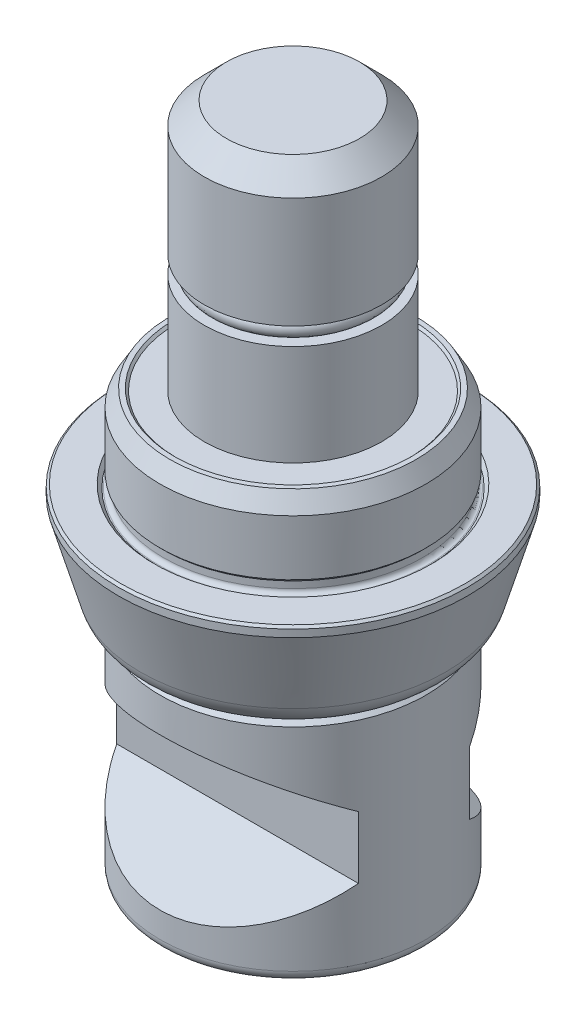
ISO-10303-21;
HEADER;
FILE_DESCRIPTION(('STEP AP214'),'2;1');
FILE_NAME('part.step','',(''),(''),'','','');
FILE_SCHEMA(('AUTOMOTIVE_DESIGN { 1 0 10303 214 1 1 1 1 }'));
ENDSEC;
DATA;
#1=APPLICATION_CONTEXT('core data for automotive mechanical design processes');
#2=APPLICATION_PROTOCOL_DEFINITION('international standard','automotive_design',2000,#1);
#3=PRODUCT_CONTEXT('',#1,'mechanical');
#4=PRODUCT('Part','Part','',(#3));
#5=PRODUCT_RELATED_PRODUCT_CATEGORY('part','',(#4));
#6=PRODUCT_DEFINITION_FORMATION('','',#4);
#7=PRODUCT_DEFINITION_CONTEXT('part definition',#1,'design');
#8=PRODUCT_DEFINITION('design','',#6,#7);
#9=PRODUCT_DEFINITION_SHAPE('','',#8);
#10=(LENGTH_UNIT() NAMED_UNIT(*) SI_UNIT(.MILLI.,.METRE.));
#11=(NAMED_UNIT(*) PLANE_ANGLE_UNIT() SI_UNIT($,.RADIAN.));
#12=(NAMED_UNIT(*) SI_UNIT($,.STERADIAN.) SOLID_ANGLE_UNIT());
#13=UNCERTAINTY_MEASURE_WITH_UNIT(LENGTH_MEASURE(1.E-05),#10,'distance_accuracy_value','');
#14=(GEOMETRIC_REPRESENTATION_CONTEXT(3) GLOBAL_UNCERTAINTY_ASSIGNED_CONTEXT((#13)) GLOBAL_UNIT_ASSIGNED_CONTEXT((#10,
#11,#12)) REPRESENTATION_CONTEXT('',''));
#15=CARTESIAN_POINT('',(0.,0.,0.));
#16=DIRECTION('',(0.,0.,1.));
#17=DIRECTION('',(1.,0.,0.));
#18=AXIS2_PLACEMENT_3D('',#15,#16,#17);
#19=CARTESIAN_POINT('',(0.,0.,0.));
#20=DIRECTION('',(0.,-1.,0.));
#21=DIRECTION('',(0.,0.,-1.));
#22=AXIS2_PLACEMENT_3D('',#19,#20,#21);
#23=CYLINDRICAL_SURFACE('',#22,12.);
#24=CARTESIAN_POINT('',(0.,1.,0.));
#25=DIRECTION('',(0.,-1.,0.));
#26=DIRECTION('',(0.,0.,-1.));
#27=AXIS2_PLACEMENT_3D('',#24,#25,#26);
#28=CIRCLE('',#27,12.);
#29=CARTESIAN_POINT('',(0.,1.,-12.));
#30=VERTEX_POINT('',#29);
#31=EDGE_CURVE('E592',#30,#30,#28,.T.);
#32=ORIENTED_EDGE('',*,*,#31,.F.);
#33=EDGE_LOOP('',(#32));
#34=FACE_BOUND('',#33,.T.);
#35=CARTESIAN_POINT('',(0.,6.,0.));
#36=DIRECTION('',(0.,1.,0.));
#37=DIRECTION('',(0.,0.,1.));
#38=AXIS2_PLACEMENT_3D('',#35,#36,#37);
#39=CIRCLE('',#38,12.);
#40=CARTESIAN_POINT('',(0.,6.,12.));
#41=VERTEX_POINT('',#40);
#42=EDGE_CURVE('E650',#41,#41,#39,.F.);
#43=ORIENTED_EDGE('',*,*,#42,.T.);
#44=EDGE_LOOP('',(#43));
#45=FACE_BOUND('',#44,.T.);
#46=ADVANCED_FACE('F16',(#34,#45),#23,.T.);
#47=CARTESIAN_POINT('',(12.,0.,0.));
#48=DIRECTION('',(0.,1.,0.));
#49=DIRECTION('',(0.,0.,1.));
#50=AXIS2_PLACEMENT_3D('',#47,#48,#49);
#51=PLANE('',#50);
#52=CARTESIAN_POINT('',(0.,0.,0.));
#53=DIRECTION('',(0.,-1.,0.));
#54=DIRECTION('',(0.,0.,-1.));
#55=AXIS2_PLACEMENT_3D('',#52,#53,#54);
#56=CIRCLE('',#55,12.5);
#57=CARTESIAN_POINT('',(0.,0.,-12.5));
#58=VERTEX_POINT('',#57);
#59=EDGE_CURVE('E638',#58,#58,#56,.T.);
#60=ORIENTED_EDGE('',*,*,#59,.T.);
#61=EDGE_LOOP('',(#60));
#62=FACE_BOUND('',#61,.T.);
#63=CARTESIAN_POINT('',(0.,0.,0.));
#64=DIRECTION('',(0.,1.,0.));
#65=DIRECTION('',(0.,0.,1.));
#66=AXIS2_PLACEMENT_3D('',#63,#64,#65);
#67=CIRCLE('',#66,15.55);
#68=CARTESIAN_POINT('',(0.,0.,15.55));
#69=VERTEX_POINT('',#68);
#70=EDGE_CURVE('E657',#69,#69,#67,.T.);
#71=ORIENTED_EDGE('',*,*,#70,.T.);
#72=EDGE_LOOP('',(#71));
#73=FACE_BOUND('',#72,.T.);
#74=ADVANCED_FACE('F436',(#62,#73),#51,.T.);
#75=CARTESIAN_POINT('',(0.,0.,0.));
#76=DIRECTION('',(0.,-1.,0.));
#77=DIRECTION('',(0.,0.,-1.));
#78=AXIS2_PLACEMENT_3D('',#75,#76,#77);
#79=CYLINDRICAL_SURFACE('',#78,15.75);
#80=CARTESIAN_POINT('',(0.,-0.199999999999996,0.));
#81=DIRECTION('',(0.,1.,0.));
#82=DIRECTION('',(0.,0.,1.));
#83=AXIS2_PLACEMENT_3D('',#80,#81,#82);
#84=CIRCLE('',#83,15.75);
#85=CARTESIAN_POINT('',(0.,-0.199999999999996,15.75));
#86=VERTEX_POINT('',#85);
#87=EDGE_CURVE('E632',#86,#86,#84,.F.);
#88=ORIENTED_EDGE('',*,*,#87,.T.);
#89=EDGE_LOOP('',(#88));
#90=FACE_BOUND('',#89,.T.);
#91=CARTESIAN_POINT('',(0.,-0.871853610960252,0.));
#92=DIRECTION('',(0.,-1.,0.));
#93=DIRECTION('',(0.,0.,-1.));
#94=AXIS2_PLACEMENT_3D('',#91,#92,#93);
#95=CIRCLE('',#94,15.75);
#96=CARTESIAN_POINT('',(0.,-0.871853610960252,-15.75));
#97=VERTEX_POINT('',#96);
#98=EDGE_CURVE('E635',#97,#97,#95,.T.);
#99=ORIENTED_EDGE('',*,*,#98,.F.);
#100=EDGE_LOOP('',(#99));
#101=FACE_BOUND('',#100,.T.);
#102=ADVANCED_FACE('F443',(#90,#101),#79,.T.);
#103=CARTESIAN_POINT('',(0.,-10.,0.));
#104=DIRECTION('',(0.,1.,0.));
#105=DIRECTION('',(0.,0.,1.));
#106=AXIS2_PLACEMENT_3D('',#103,#104,#105);
#107=CONICAL_SURFACE('',#106,13.132546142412,0.279252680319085);
#108=CARTESIAN_POINT('',(0.,-7.82691206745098,0.));
#109=DIRECTION('',(0.,-1.,0.));
#110=DIRECTION('',(0.,0.,-1.));
#111=AXIS2_PLACEMENT_3D('',#108,#109,#110);
#112=CIRCLE('',#111,13.7556690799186);
#113=CARTESIAN_POINT('',(0.,-7.82691206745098,-13.7556690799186));
#114=VERTEX_POINT('',#113);
#115=EDGE_CURVE('E641',#114,#114,#112,.F.);
#116=ORIENTED_EDGE('',*,*,#115,.T.);
#117=EDGE_LOOP('',(#116));
#118=FACE_BOUND('',#117,.T.);
#119=ORIENTED_EDGE('',*,*,#98,.T.);
#120=EDGE_LOOP('',(#119));
#121=FACE_BOUND('',#120,.T.);
#122=ADVANCED_FACE('F619',(#118,#121),#107,.T.);
#123=CARTESIAN_POINT('',(8.,7.5,0.));
#124=DIRECTION('',(0.,1.,0.));
#125=DIRECTION('',(0.,0.,1.));
#126=AXIS2_PLACEMENT_3D('',#123,#124,#125);
#127=PLANE('',#126);
#128=CARTESIAN_POINT('',(0.,7.5,0.));
#129=DIRECTION('',(0.,1.,0.));
#130=DIRECTION('',(0.,0.,1.));
#131=AXIS2_PLACEMENT_3D('',#128,#129,#130);
#132=CIRCLE('',#131,10.7);
#133=CARTESIAN_POINT('',(0.,7.5,10.7));
#134=VERTEX_POINT('',#133);
#135=EDGE_CURVE('E480',#134,#134,#132,.F.);
#136=ORIENTED_EDGE('',*,*,#135,.T.);
#137=EDGE_LOOP('',(#136));
#138=FACE_BOUND('',#137,.T.);
#139=CARTESIAN_POINT('',(0.,7.5,0.));
#140=DIRECTION('',(0.,1.,0.));
#141=DIRECTION('',(0.,0.,1.));
#142=AXIS2_PLACEMENT_3D('',#139,#140,#141);
#143=CIRCLE('',#142,11.1339745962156);
#144=CARTESIAN_POINT('',(0.,7.5,11.1339745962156));
#145=VERTEX_POINT('',#144);
#146=EDGE_CURVE('E653',#145,#145,#143,.T.);
#147=ORIENTED_EDGE('',*,*,#146,.T.);
#148=EDGE_LOOP('',(#147));
#149=FACE_BOUND('',#148,.T.);
#150=ADVANCED_FACE('F454',(#138,#149),#127,.T.);
#151=CARTESIAN_POINT('',(0.,-7.,0.));
#152=DIRECTION('',(0.,-1.,0.));
#153=DIRECTION('',(0.,0.,-1.));
#154=AXIS2_PLACEMENT_3D('',#151,#152,#153);
#155=TOROIDAL_SURFACE('',#154,10.8718839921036,3.);
#156=ORIENTED_EDGE('',*,*,#115,.F.);
#157=EDGE_LOOP('',(#156));
#158=FACE_BOUND('',#157,.T.);
#159=CARTESIAN_POINT('',(0.,-10.,0.));
#160=DIRECTION('',(0.,-1.,0.));
#161=DIRECTION('',(0.,0.,-1.));
#162=AXIS2_PLACEMENT_3D('',#159,#160,#161);
#163=CIRCLE('',#162,10.8718839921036);
#164=CARTESIAN_POINT('',(0.,-10.,-10.8718839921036));
#165=VERTEX_POINT('',#164);
#166=EDGE_CURVE('E637',#165,#165,#163,.T.);
#167=ORIENTED_EDGE('',*,*,#166,.F.);
#168=EDGE_LOOP('',(#167));
#169=FACE_BOUND('',#168,.T.);
#170=ADVANCED_FACE('F450',(#158,#169),#155,.T.);
#171=CARTESIAN_POINT('',(0.,6.,0.));
#172=DIRECTION('',(0.,-1.,0.));
#173=DIRECTION('',(0.,0.,-1.));
#174=AXIS2_PLACEMENT_3D('',#171,#172,#173);
#175=CONICAL_SURFACE('',#174,12.,0.523598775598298);
#176=ORIENTED_EDGE('',*,*,#146,.F.);
#177=EDGE_LOOP('',(#176));
#178=FACE_BOUND('',#177,.T.);
#179=ORIENTED_EDGE('',*,*,#42,.F.);
#180=EDGE_LOOP('',(#179));
#181=FACE_BOUND('',#180,.T.);
#182=ADVANCED_FACE('F453',(#178,#181),#175,.T.);
#183=CARTESIAN_POINT('',(0.,-0.199999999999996,0.));
#184=DIRECTION('',(0.,-1.,0.));
#185=DIRECTION('',(0.,0.,-1.));
#186=AXIS2_PLACEMENT_3D('',#183,#184,#185);
#187=CONICAL_SURFACE('',#186,15.75,0.785398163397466);
#188=ORIENTED_EDGE('',*,*,#70,.F.);
#189=EDGE_LOOP('',(#188));
#190=FACE_BOUND('',#189,.T.);
#191=ORIENTED_EDGE('',*,*,#87,.F.);
#192=EDGE_LOOP('',(#191));
#193=FACE_BOUND('',#192,.T.);
#194=ADVANCED_FACE('F458',(#190,#193),#187,.T.);
#195=CARTESIAN_POINT('',(0.,-0.3,0.));
#196=DIRECTION('',(0.,1.,0.));
#197=DIRECTION('',(0.,0.,1.));
#198=AXIS2_PLACEMENT_3D('',#195,#196,#197);
#199=CONICAL_SURFACE('',#198,12.2,0.78539816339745);
#200=ORIENTED_EDGE('',*,*,#59,.F.);
#201=EDGE_LOOP('',(#200));
#202=FACE_BOUND('',#201,.T.);
#203=CARTESIAN_POINT('',(0.,-0.3,0.));
#204=DIRECTION('',(0.,-1.,0.));
#205=DIRECTION('',(0.,0.,-1.));
#206=AXIS2_PLACEMENT_3D('',#203,#204,#205);
#207=CIRCLE('',#206,12.2);
#208=CARTESIAN_POINT('',(0.,-0.3,-12.2));
#209=VERTEX_POINT('',#208);
#210=EDGE_CURVE('E644',#209,#209,#207,.T.);
#211=ORIENTED_EDGE('',*,*,#210,.T.);
#212=EDGE_LOOP('',(#211));
#213=FACE_BOUND('',#212,.T.);
#214=ADVANCED_FACE('F462',(#202,#213),#199,.F.);
#215=CARTESIAN_POINT('',(11.7,-0.3,0.));
#216=DIRECTION('',(0.,-1.,0.));
#217=DIRECTION('',(0.,0.,-1.));
#218=AXIS2_PLACEMENT_3D('',#215,#216,#217);
#219=PLANE('',#218);
#220=CARTESIAN_POINT('',(0.,-0.3,0.));
#221=DIRECTION('',(0.,-1.,0.));
#222=DIRECTION('',(0.,0.,-1.));
#223=AXIS2_PLACEMENT_3D('',#220,#221,#222);
#224=CIRCLE('',#223,12.1);
#225=CARTESIAN_POINT('',(0.,-0.3,-12.1));
#226=VERTEX_POINT('',#225);
#227=EDGE_CURVE('E490',#226,#226,#224,.T.);
#228=ORIENTED_EDGE('',*,*,#227,.T.);
#229=EDGE_LOOP('',(#228));
#230=FACE_BOUND('',#229,.T.);
#231=ORIENTED_EDGE('',*,*,#210,.F.);
#232=EDGE_LOOP('',(#231));
#233=FACE_BOUND('',#232,.T.);
#234=ADVANCED_FACE('F609',(#230,#233),#219,.F.);
#235=CARTESIAN_POINT('',(0.,0.,0.));
#236=DIRECTION('',(0.,-1.,0.));
#237=DIRECTION('',(0.,0.,-1.));
#238=AXIS2_PLACEMENT_3D('',#235,#236,#237);
#239=CYLINDRICAL_SURFACE('',#238,11.7);
#240=CARTESIAN_POINT('',(0.,0.1,0.));
#241=DIRECTION('',(0.,-1.,0.));
#242=DIRECTION('',(0.,0.,-1.));
#243=AXIS2_PLACEMENT_3D('',#240,#241,#242);
#244=CIRCLE('',#243,11.7);
#245=CARTESIAN_POINT('',(0.,0.1,-11.7));
#246=VERTEX_POINT('',#245);
#247=EDGE_CURVE('E485',#246,#246,#244,.F.);
#248=ORIENTED_EDGE('',*,*,#247,.T.);
#249=EDGE_LOOP('',(#248));
#250=FACE_BOUND('',#249,.T.);
#251=CARTESIAN_POINT('',(0.,0.7,0.));
#252=DIRECTION('',(0.,-1.,0.));
#253=DIRECTION('',(0.,0.,-1.));
#254=AXIS2_PLACEMENT_3D('',#251,#252,#253);
#255=CIRCLE('',#254,11.7);
#256=CARTESIAN_POINT('',(0.,0.7,-11.7));
#257=VERTEX_POINT('',#256);
#258=EDGE_CURVE('E666',#257,#257,#255,.T.);
#259=ORIENTED_EDGE('',*,*,#258,.T.);
#260=EDGE_LOOP('',(#259));
#261=FACE_BOUND('',#260,.T.);
#262=ADVANCED_FACE('F605',(#250,#261),#239,.T.);
#263=CARTESIAN_POINT('',(0.,1.,0.));
#264=DIRECTION('',(0.,1.,0.));
#265=DIRECTION('',(0.,0.,1.));
#266=AXIS2_PLACEMENT_3D('',#263,#264,#265);
#267=CONICAL_SURFACE('',#266,12.,0.78539816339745);
#268=ORIENTED_EDGE('',*,*,#258,.F.);
#269=EDGE_LOOP('',(#268));
#270=FACE_BOUND('',#269,.T.);
#271=ORIENTED_EDGE('',*,*,#31,.T.);
#272=EDGE_LOOP('',(#271));
#273=FACE_BOUND('',#272,.T.);
#274=ADVANCED_FACE('F467',(#270,#273),#267,.T.);
#275=CARTESIAN_POINT('',(0.,0.1,0.));
#276=DIRECTION('',(0.,-1.,0.));
#277=DIRECTION('',(0.,0.,-1.));
#278=AXIS2_PLACEMENT_3D('',#275,#276,#277);
#279=TOROIDAL_SURFACE('',#278,12.1,0.4);
#280=ORIENTED_EDGE('',*,*,#247,.F.);
#281=EDGE_LOOP('',(#280));
#282=FACE_BOUND('',#281,.T.);
#283=ORIENTED_EDGE('',*,*,#227,.F.);
#284=EDGE_LOOP('',(#283));
#285=FACE_BOUND('',#284,.T.);
#286=ADVANCED_FACE('F464',(#282,#285),#279,.F.);
#287=CARTESIAN_POINT('',(0.,7.3,0.));
#288=DIRECTION('',(0.,1.,0.));
#289=DIRECTION('',(0.,0.,1.));
#290=AXIS2_PLACEMENT_3D('',#287,#288,#289);
#291=CONICAL_SURFACE('',#290,10.5,0.785398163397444);
#292=ORIENTED_EDGE('',*,*,#135,.F.);
#293=EDGE_LOOP('',(#292));
#294=FACE_BOUND('',#293,.T.);
#295=CARTESIAN_POINT('',(0.,7.3,0.));
#296=DIRECTION('',(0.,1.,0.));
#297=DIRECTION('',(0.,0.,1.));
#298=AXIS2_PLACEMENT_3D('',#295,#296,#297);
#299=CIRCLE('',#298,10.5);
#300=CARTESIAN_POINT('',(0.,7.3,10.5));
#301=VERTEX_POINT('',#300);
#302=EDGE_CURVE('E483',#301,#301,#299,.T.);
#303=ORIENTED_EDGE('',*,*,#302,.F.);
#304=EDGE_LOOP('',(#303));
#305=FACE_BOUND('',#304,.T.);
#306=ADVANCED_FACE('F466',(#294,#305),#291,.F.);
#307=CARTESIAN_POINT('',(0.,-26.1,0.));
#308=DIRECTION('',(0.,-1.,0.));
#309=DIRECTION('',(0.,0.,1.));
#310=AXIS2_PLACEMENT_3D('',#307,#308,#309);
#311=PLANE('',#310);
#312=DIRECTION('',(0.,0.,1.));
#313=VECTOR('',#312,1.);
#314=CARTESIAN_POINT('',(3.,-26.1,-1.73205080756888));
#315=LINE('',#314,#313);
#316=CARTESIAN_POINT('',(3.,-26.1,-1.73205080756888));
#317=VERTEX_POINT('',#316);
#318=CARTESIAN_POINT('',(3.,-26.1,1.73205080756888));
#319=VERTEX_POINT('',#318);
#320=EDGE_CURVE('E293',#317,#319,#315,.T.);
#321=ORIENTED_EDGE('',*,*,#320,.T.);
#322=DIRECTION('',(-0.86602540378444,0.,0.5));
#323=VECTOR('',#322,1.);
#324=CARTESIAN_POINT('',(3.,-26.1,1.73205080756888));
#325=LINE('',#324,#323);
#326=CARTESIAN_POINT('',(0.,-26.1,3.46410161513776));
#327=VERTEX_POINT('',#326);
#328=EDGE_CURVE('E286',#319,#327,#325,.T.);
#329=ORIENTED_EDGE('',*,*,#328,.T.);
#330=DIRECTION('',(-0.86602540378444,0.,-0.5));
#331=VECTOR('',#330,1.);
#332=CARTESIAN_POINT('',(0.,-26.1,3.46410161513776));
#333=LINE('',#332,#331);
#334=CARTESIAN_POINT('',(-3.,-26.1,1.73205080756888));
#335=VERTEX_POINT('',#334);
#336=EDGE_CURVE('E290',#327,#335,#333,.T.);
#337=ORIENTED_EDGE('',*,*,#336,.T.);
#338=DIRECTION('',(0.,0.,-1.));
#339=VECTOR('',#338,1.);
#340=CARTESIAN_POINT('',(-3.,-26.1,1.73205080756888));
#341=LINE('',#340,#339);
#342=CARTESIAN_POINT('',(-3.,-26.1,-1.73205080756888));
#343=VERTEX_POINT('',#342);
#344=EDGE_CURVE('E515',#335,#343,#341,.T.);
#345=ORIENTED_EDGE('',*,*,#344,.T.);
#346=DIRECTION('',(0.86602540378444,0.,-0.5));
#347=VECTOR('',#346,1.);
#348=CARTESIAN_POINT('',(-3.,-26.1,-1.73205080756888));
#349=LINE('',#348,#347);
#350=CARTESIAN_POINT('',(0.,-26.1,-3.46410161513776));
#351=VERTEX_POINT('',#350);
#352=EDGE_CURVE('E513',#343,#351,#349,.T.);
#353=ORIENTED_EDGE('',*,*,#352,.T.);
#354=DIRECTION('',(0.86602540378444,0.,0.5));
#355=VECTOR('',#354,1.);
#356=CARTESIAN_POINT('',(0.,-26.1,-3.46410161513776));
#357=LINE('',#356,#355);
#358=EDGE_CURVE('E297',#351,#317,#357,.T.);
#359=ORIENTED_EDGE('',*,*,#358,.T.);
#360=EDGE_LOOP('',(#321,#329,#337,#345,#353,#359));
#361=FACE_BOUND('',#360,.T.);
#362=ADVANCED_FACE('F376',(#361),#311,.T.);
#363=CARTESIAN_POINT('',(-12.,-30.6,15.));
#364=DIRECTION('',(0.,1.,0.));
#365=DIRECTION('',(1.,0.,0.));
#366=AXIS2_PLACEMENT_3D('',#363,#364,#365);
#367=PLANE('',#366);
#368=DIRECTION('',(0.960294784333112,0.,0.2789873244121));
#369=VECTOR('',#368,1.);
#370=CARTESIAN_POINT('',(3.05770783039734,-30.6,-8.14229068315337));
#371=LINE('',#370,#369);
#372=CARTESIAN_POINT('',(3.05770783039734,-30.6,-8.14229068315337));
#373=VERTEX_POINT('',#372);
#374=CARTESIAN_POINT('',(3.97986109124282,-30.6,-7.87438433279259));
#375=VERTEX_POINT('',#374);
#376=EDGE_CURVE('E565',#373,#375,#371,.T.);
#377=ORIENTED_EDGE('',*,*,#376,.T.);
#378=DIRECTION('',(-0.278795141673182,0.,0.960350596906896));
#379=VECTOR('',#378,1.);
#380=CARTESIAN_POINT('',(3.97986109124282,-30.6,-7.87438433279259));
#381=LINE('',#380,#379);
#382=CARTESIAN_POINT('',(3.52981109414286,-30.6,-6.32412136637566));
#383=VERTEX_POINT('',#382);
#384=EDGE_CURVE('E31',#375,#383,#381,.T.);
#385=ORIENTED_EDGE('',*,*,#384,.T.);
#386=DIRECTION('',(-0.25132430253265,0.,-0.967902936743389));
#387=VECTOR('',#386,1.);
#388=CARTESIAN_POINT('',(3.52981109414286,-30.6,-6.32412136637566));
#389=LINE('',#388,#387);
#390=EDGE_CURVE('E567',#383,#373,#389,.T.);
#391=ORIENTED_EDGE('',*,*,#390,.T.);
#392=EDGE_LOOP('',(#377,#385,#391));
#393=FACE_BOUND('',#392,.T.);
#394=ADVANCED_FACE('F475',(#393),#367,.F.);
#395=CARTESIAN_POINT('',(-1.08798560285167,-30.6,-6.56386084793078));
#396=CARTESIAN_POINT('',(-1.10697976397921,-30.6,-6.53830486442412));
#397=CARTESIAN_POINT('',(-1.14574813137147,-30.6,-6.48614337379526));
#398=CARTESIAN_POINT('',(-1.21733670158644,-30.6,-6.41542177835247));
#399=CARTESIAN_POINT('',(-1.30139570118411,-30.6,-6.35060788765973));
#400=CARTESIAN_POINT('',(-1.39629370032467,-30.6,-6.28879248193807));
#401=CARTESIAN_POINT('',(-1.50433934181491,-30.6,-6.23372432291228));
#402=CARTESIAN_POINT('',(-1.62373409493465,-30.6,-6.18268128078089));
#403=CARTESIAN_POINT('',(-1.75480499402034,-30.6,-6.13445235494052));
#404=CARTESIAN_POINT('',(-1.84765112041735,-30.6,-6.10902481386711));
#405=CARTESIAN_POINT('',(-1.8957885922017,-30.6,-6.09584152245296));
#406=B_SPLINE_CURVE_WITH_KNOTS('',3,(#395,#396,#397,#398,#399,#400,#401,#402,#403,#404,#405),
.UNSPECIFIED.,.F.,.F.,(4,1,1,1,1,1,1,1,4),(0.,0.100171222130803,0.204456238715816,
0.315607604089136,0.434050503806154,0.560607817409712,0.696953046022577,0.842880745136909,1.),.UNSPECIFIED.);
#407=CARTESIAN_POINT('',(-1.08798560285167,-30.6,-6.56386084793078));
#408=VERTEX_POINT('',#407);
#409=CARTESIAN_POINT('',(-1.8957885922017,-30.6,-6.09584152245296));
#410=VERTEX_POINT('',#409);
#411=EDGE_CURVE('E1218',#408,#410,#406,.T.);
#412=ORIENTED_EDGE('',*,*,#411,.T.);
#413=DIRECTION('',(-0.187359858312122,0.,-0.982291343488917));
#414=VECTOR('',#413,1.);
#415=CARTESIAN_POINT('',(-1.8957885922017,-30.6,-6.09584152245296));
#416=LINE('',#415,#414);
#417=CARTESIAN_POINT('',(-2.34992252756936,-30.6,-8.47677753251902));
#418=VERTEX_POINT('',#417);
#419=EDGE_CURVE('E1048',#410,#418,#416,.T.);
#420=ORIENTED_EDGE('',*,*,#419,.T.);
#421=CARTESIAN_POINT('',(-2.34992252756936,-30.6,-8.47677753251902));
#422=CARTESIAN_POINT('',(-2.3004227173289,-30.6,-8.48210394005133));
#423=CARTESIAN_POINT('',(-2.20459662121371,-30.6,-8.49241526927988));
#424=CARTESIAN_POINT('',(-2.06511760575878,-30.6,-8.49598049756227));
#425=CARTESIAN_POINT('',(-1.93528457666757,-30.6,-8.49219938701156));
#426=CARTESIAN_POINT('',(-1.81464578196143,-30.6,-8.48076151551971));
#427=CARTESIAN_POINT('',(-1.70344124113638,-30.6,-8.45851932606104));
#428=CARTESIAN_POINT('',(-1.60148286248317,-30.6,-8.42860250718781));
#429=CARTESIAN_POINT('',(-1.50874351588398,-30.6,-8.39001684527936));
#430=CARTESIAN_POINT('',(-1.45377381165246,-30.6,-8.35555524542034));
#431=CARTESIAN_POINT('',(-1.42695247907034,-30.6,-8.33874041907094));
#432=B_SPLINE_CURVE_WITH_KNOTS('',3,(#421,#422,#423,#424,#425,#426,#427,#428,#429,#430,#431),
.UNSPECIFIED.,.F.,.F.,(4,1,1,1,1,1,1,1,4),(0.,0.156805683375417,0.303558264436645,
0.439164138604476,0.565920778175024,0.684863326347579,0.795869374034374,0.900398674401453,1.),.UNSPECIFIED.);
#433=CARTESIAN_POINT('',(-1.42695247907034,-30.6,-8.33874041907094));
#434=VERTEX_POINT('',#433);
#435=EDGE_CURVE('E1052',#418,#434,#432,.T.);
#436=ORIENTED_EDGE('',*,*,#435,.T.);
#437=CARTESIAN_POINT('',(-1.42695247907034,-30.6,-8.33874041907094));
#438=CARTESIAN_POINT('',(-1.39557157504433,-30.6,-8.31607361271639));
#439=CARTESIAN_POINT('',(-1.33293216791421,-30.6,-8.27082841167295));
#440=CARTESIAN_POINT('',(-1.24982679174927,-30.6,-8.18937932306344));
#441=CARTESIAN_POINT('',(-1.17385786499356,-30.6,-8.10019677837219));
#442=CARTESIAN_POINT('',(-1.10773635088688,-30.6,-8.00072894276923));
#443=CARTESIAN_POINT('',(-1.05055730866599,-30.6,-7.8921519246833));
#444=CARTESIAN_POINT('',(-1.00133285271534,-30.6,-7.77474495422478));
#445=CARTESIAN_POINT('',(-0.96100800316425,-30.6,-7.64763087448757));
#446=CARTESIAN_POINT('',(-0.942362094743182,-30.6,-7.55862956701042));
#447=CARTESIAN_POINT('',(-0.932795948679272,-30.6,-7.51296810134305));
#448=B_SPLINE_CURVE_WITH_KNOTS('',3,(#437,#438,#439,#440,#441,#442,#443,#444,#445,#446,#447),
.UNSPECIFIED.,.F.,.F.,(4,1,1,1,1,1,1,1,4),(0.,0.117356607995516,0.234255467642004,
0.352134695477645,0.472471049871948,0.595950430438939,0.724111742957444,0.858457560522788,1.),.UNSPECIFIED.);
#449=CARTESIAN_POINT('',(-0.932795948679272,-30.6,-7.51296810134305));
#450=VERTEX_POINT('',#449);
#451=EDGE_CURVE('E1236',#434,#450,#448,.T.);
#452=ORIENTED_EDGE('',*,*,#451,.T.);
#453=CARTESIAN_POINT('',(-0.932795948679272,-30.6,-7.51296810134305));
#454=CARTESIAN_POINT('',(-0.924845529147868,-30.6,-7.46706410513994));
#455=CARTESIAN_POINT('',(-0.909345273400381,-30.6,-7.37756899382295));
#456=CARTESIAN_POINT('',(-0.90119770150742,-30.6,-7.2446482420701));
#457=CARTESIAN_POINT('',(-0.901839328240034,-30.6,-7.11725963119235));
#458=CARTESIAN_POINT('',(-0.915958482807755,-30.6,-6.99522789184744));
#459=CARTESIAN_POINT('',(-0.941116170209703,-30.6,-6.87855177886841));
#460=CARTESIAN_POINT('',(-0.978145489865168,-30.6,-6.76768583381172));
#461=CARTESIAN_POINT('',(-1.0262466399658,-30.6,-6.66194578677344));
#462=CARTESIAN_POINT('',(-1.06734646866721,-30.6,-6.59665032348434));
#463=CARTESIAN_POINT('',(-1.08798560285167,-30.6,-6.56386084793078));
#464=B_SPLINE_CURVE_WITH_KNOTS('',3,(#453,#454,#455,#456,#457,#458,#459,#460,#461,#462,#463),
.UNSPECIFIED.,.F.,.F.,(4,1,1,1,1,1,1,1,4),(0.,0.141417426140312,0.27570950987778,
0.403914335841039,0.52794562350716,0.648154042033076,0.765846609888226,0.88241500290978,1.),.UNSPECIFIED.);
#465=EDGE_CURVE('E1220',#450,#408,#464,.T.);
#466=ORIENTED_EDGE('',*,*,#465,.T.);
#467=EDGE_LOOP('',(#412,#420,#436,#452,#466));
#468=FACE_BOUND('',#467,.T.);
#469=ADVANCED_FACE('F829',(#468),#367,.F.);
#470=CARTESIAN_POINT('',(-3.59143976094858,-30.6,-7.92544586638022));
#471=CARTESIAN_POINT('',(-3.57362078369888,-30.6,-7.95079696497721));
#472=CARTESIAN_POINT('',(-3.53716683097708,-30.6,-8.00266008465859));
#473=CARTESIAN_POINT('',(-3.46769533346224,-30.6,-8.0713046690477));
#474=CARTESIAN_POINT('',(-3.38935327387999,-30.6,-8.13765913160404));
#475=CARTESIAN_POINT('',(-3.29732663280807,-30.6,-8.19688378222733));
#476=CARTESIAN_POINT('',(-3.19458651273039,-30.6,-8.2521624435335));
#477=CARTESIAN_POINT('',(-3.08019362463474,-30.6,-8.30292663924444));
#478=CARTESIAN_POINT('',(-2.95432939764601,-30.6,-8.34861971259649));
#479=CARTESIAN_POINT('',(-2.86549028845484,-30.6,-8.37387708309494));
#480=CARTESIAN_POINT('',(-2.81957542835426,-30.6,-8.38693089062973));
#481=B_SPLINE_CURVE_WITH_KNOTS('',3,(#470,#471,#472,#473,#474,#475,#476,#477,#478,#479,#480),
.UNSPECIFIED.,.F.,.F.,(4,1,1,1,1,1,1,1,4),(0.,0.101000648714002,0.206626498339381,
0.317730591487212,0.435848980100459,0.563147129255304,0.698466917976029,0.84415817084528,1.),.UNSPECIFIED.);
#482=CARTESIAN_POINT('',(-3.59143976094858,-30.6,-7.92544586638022));
#483=VERTEX_POINT('',#482);
#484=CARTESIAN_POINT('',(-2.81957542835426,-30.6,-8.38693089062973));
#485=VERTEX_POINT('',#484);
#486=EDGE_CURVE('E1043',#483,#485,#481,.T.);
#487=ORIENTED_EDGE('',*,*,#486,.T.);
#488=DIRECTION('',(0.187359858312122,0.,0.982291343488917));
#489=VECTOR('',#488,1.);
#490=CARTESIAN_POINT('',(-2.81957542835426,-30.6,-8.38693089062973));
#491=LINE('',#490,#489);
#492=CARTESIAN_POINT('',(-2.3654414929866,-30.6,-6.00599488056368));
#493=VERTEX_POINT('',#492);
#494=EDGE_CURVE('E1044',#485,#493,#491,.T.);
#495=ORIENTED_EDGE('',*,*,#494,.T.);
#496=CARTESIAN_POINT('',(-2.3654414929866,-30.6,-6.00599488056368));
#497=CARTESIAN_POINT('',(-2.412774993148,-30.6,-6.00137802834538));
#498=CARTESIAN_POINT('',(-2.5045774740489,-30.6,-5.99242372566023));
#499=CARTESIAN_POINT('',(-2.63826516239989,-30.6,-5.98816267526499));
#500=CARTESIAN_POINT('',(-2.76330338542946,-30.6,-5.99280727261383));
#501=CARTESIAN_POINT('',(-2.87924689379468,-30.6,-6.00620408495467));
#502=CARTESIAN_POINT('',(-2.98613258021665,-30.6,-6.029175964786));
#503=CARTESIAN_POINT('',(-3.08404815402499,-30.6,-6.059959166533));
#504=CARTESIAN_POINT('',(-3.17322082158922,-30.6,-6.09961051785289));
#505=CARTESIAN_POINT('',(-3.22644237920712,-30.6,-6.13382976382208));
#506=CARTESIAN_POINT('',(-3.2524728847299,-30.6,-6.15056629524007));
#507=B_SPLINE_CURVE_WITH_KNOTS('',3,(#496,#497,#498,#499,#500,#501,#502,#503,#504,#505,#506),
.UNSPECIFIED.,.F.,.F.,(4,1,1,1,1,1,1,1,4),(0.,0.155394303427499,0.301384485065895,
0.436734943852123,0.563984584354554,0.682307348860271,0.793457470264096,0.898980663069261,1.),.UNSPECIFIED.);
#508=CARTESIAN_POINT('',(-3.2524728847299,-30.6,-6.15056629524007));
#509=VERTEX_POINT('',#508);
#510=EDGE_CURVE('E1069',#493,#509,#507,.T.);
#511=ORIENTED_EDGE('',*,*,#510,.T.);
#512=CARTESIAN_POINT('',(-3.2524728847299,-30.6,-6.15056629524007));
#513=CARTESIAN_POINT('',(-3.28379201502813,-30.6,-6.17329477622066));
#514=CARTESIAN_POINT('',(-3.34646752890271,-30.6,-6.21877877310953));
#515=CARTESIAN_POINT('',(-3.43048789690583,-30.6,-6.29935126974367));
#516=CARTESIAN_POINT('',(-3.50526063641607,-30.6,-6.38931325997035));
#517=CARTESIAN_POINT('',(-3.57176170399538,-30.6,-6.48807303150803));
#518=CARTESIAN_POINT('',(-3.63022352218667,-30.6,-6.59612398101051));
#519=CARTESIAN_POINT('',(-3.67762378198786,-30.6,-6.71460168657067));
#520=CARTESIAN_POINT('',(-3.71841520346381,-30.6,-6.84138188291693));
#521=CARTESIAN_POINT('',(-3.73708013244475,-30.6,-6.93012129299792));
#522=CARTESIAN_POINT('',(-3.74662941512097,-30.6,-6.97552182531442));
#523=B_SPLINE_CURVE_WITH_KNOTS('',3,(#512,#513,#514,#515,#516,#517,#518,#519,#520,#521,#522),
.UNSPECIFIED.,.F.,.F.,(4,1,1,1,1,1,1,1,4),(0.,0.117425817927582,0.234991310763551,
0.352408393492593,0.472129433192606,0.596071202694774,0.724755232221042,0.859180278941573,1.),.UNSPECIFIED.);
#524=CARTESIAN_POINT('',(-3.74662941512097,-30.6,-6.97552182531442));
#525=VERTEX_POINT('',#524);
#526=EDGE_CURVE('E1050',#509,#525,#523,.T.);
#527=ORIENTED_EDGE('',*,*,#526,.T.);
#528=CARTESIAN_POINT('',(-3.74662941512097,-30.6,-6.97552182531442));
#529=CARTESIAN_POINT('',(-3.75444509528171,-30.6,-7.02143156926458));
#530=CARTESIAN_POINT('',(-3.76968589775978,-30.6,-7.11095689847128));
#531=CARTESIAN_POINT('',(-3.779719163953,-30.6,-7.24409401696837));
#532=CARTESIAN_POINT('',(-3.77698455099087,-30.6,-7.37143602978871));
#533=CARTESIAN_POINT('',(-3.76461975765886,-30.6,-7.49360342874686));
#534=CARTESIAN_POINT('',(-3.73881345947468,-30.6,-7.61012002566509));
#535=CARTESIAN_POINT('',(-3.7025121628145,-30.6,-7.72163439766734));
#536=CARTESIAN_POINT('',(-3.65298049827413,-30.6,-7.82714788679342));
#537=CARTESIAN_POINT('',(-3.6119922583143,-30.6,-7.89261770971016));
#538=CARTESIAN_POINT('',(-3.59143976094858,-30.6,-7.92544586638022));
#539=B_SPLINE_CURVE_WITH_KNOTS('',3,(#528,#529,#530,#531,#532,#533,#534,#535,#536,#537,#538),
.UNSPECIFIED.,.F.,.F.,(4,1,1,1,1,1,1,1,4),(0.,0.141259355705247,0.275459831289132,
0.40436065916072,0.527341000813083,0.647415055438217,0.76576009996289,0.882546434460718,1.),.UNSPECIFIED.);
#540=EDGE_CURVE('E1047',#525,#483,#539,.T.);
#541=ORIENTED_EDGE('',*,*,#540,.T.);
#542=EDGE_LOOP('',(#487,#495,#511,#527,#541));
#543=FACE_BOUND('',#542,.T.);
#544=ADVANCED_FACE('F434',(#543),#367,.F.);
#545=CARTESIAN_POINT('',(0.,-26.1,3.46410161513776));
#546=DIRECTION('',(-0.5,0.,0.86602540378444));
#547=DIRECTION('',(0.86602540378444,0.,0.5));
#548=AXIS2_PLACEMENT_3D('',#545,#546,#547);
#549=PLANE('',#548);
#550=CARTESIAN_POINT('',(-3.0002,-30.4350031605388,1.73193533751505));
#551=CARTESIAN_POINT('',(-2.86836479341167,-30.3910410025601,1.80805042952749));
#552=CARTESIAN_POINT('',(-2.73539159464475,-30.3510588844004,1.88482254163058));
#553=CARTESIAN_POINT('',(-2.46714257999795,-30.2812693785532,2.03969618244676));
#554=CARTESIAN_POINT('',(-2.33186199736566,-30.2514866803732,2.11780046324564));
#555=CARTESIAN_POINT('',(-2.06297739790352,-30.205125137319,2.27304105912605));
#556=CARTESIAN_POINT('',(-1.92941475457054,-30.1882377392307,2.35015348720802));
#557=CARTESIAN_POINT('',(-1.66166094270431,-30.1680769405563,2.50474122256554));
#558=CARTESIAN_POINT('',(-1.52747074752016,-30.1647868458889,2.58221596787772));
#559=CARTESIAN_POINT('',(-1.27672440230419,-30.1716278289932,2.72698443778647));
#560=CARTESIAN_POINT('',(-1.16013073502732,-30.1800792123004,2.79429982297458));
#561=CARTESIAN_POINT('',(-0.927703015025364,-30.2068662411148,2.92849202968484));
#562=CARTESIAN_POINT('',(-0.811869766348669,-30.2252110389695,2.99536838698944));
#563=CARTESIAN_POINT('',(-0.578962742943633,-30.2710720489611,3.12983731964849));
#564=CARTESIAN_POINT('',(-0.46191844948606,-30.2987826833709,3.19741287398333));
#565=CARTESIAN_POINT('',(-0.229575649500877,-30.3616750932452,3.33155605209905));
#566=CARTESIAN_POINT('',(-0.114274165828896,-30.3968420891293,3.39812539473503));
#567=CARTESIAN_POINT('',(0.000199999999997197,-30.4350031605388,3.4642170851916));
#568=B_SPLINE_CURVE_WITH_KNOTS('',3,(#550,#551,#552,#553,#554,#555,#556,#557,#558,#559,#560,
#561,#562,#563,#564,#565,#566,#567),.UNSPECIFIED.,.F.,.F.,(4,2,2,2,2,2,2,2,4),(0.,
0.475539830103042,0.952222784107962,1.41710776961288,1.88142182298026,2.28572436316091,
2.69040156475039,3.10405572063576,3.5168974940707),.UNSPECIFIED.);
#569=CARTESIAN_POINT('',(-3.,-30.4349364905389,1.73205080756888));
#570=VERTEX_POINT('',#569);
#571=CARTESIAN_POINT('',(0.,-30.4349364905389,3.46410161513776));
#572=VERTEX_POINT('',#571);
#573=EDGE_CURVE('E264',#570,#572,#568,.T.);
#574=ORIENTED_EDGE('',*,*,#573,.F.);
#575=DIRECTION('',(0.,-1.,0.));
#576=VECTOR('',#575,1.);
#577=CARTESIAN_POINT('',(-3.,-26.1,1.73205080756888));
#578=LINE('',#577,#576);
#579=EDGE_CURVE('E292',#335,#570,#578,.T.);
#580=ORIENTED_EDGE('',*,*,#579,.F.);
#581=ORIENTED_EDGE('',*,*,#336,.F.);
#582=DIRECTION('',(0.,-1.,0.));
#583=VECTOR('',#582,1.);
#584=CARTESIAN_POINT('',(0.,-26.1,3.46410161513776));
#585=LINE('',#584,#583);
#586=EDGE_CURVE('E283',#327,#572,#585,.T.);
#587=ORIENTED_EDGE('',*,*,#586,.T.);
#588=EDGE_LOOP('',(#574,#580,#581,#587));
#589=FACE_BOUND('',#588,.T.);
#590=ADVANCED_FACE('F289',(#589),#549,.F.);
#591=CARTESIAN_POINT('',(-3.,-26.1,1.73205080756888));
#592=DIRECTION('',(-1.,0.,0.));
#593=DIRECTION('',(0.,0.,1.));
#594=AXIS2_PLACEMENT_3D('',#591,#592,#593);
#595=PLANE('',#594);
#596=CARTESIAN_POINT('',(-3.,-31.9126261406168,-5.22331081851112));
#597=CARTESIAN_POINT('',(-3.,-31.8500953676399,-5.09839207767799));
#598=CARTESIAN_POINT('',(-3.,-31.7879936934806,-4.97325627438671));
#599=CARTESIAN_POINT('',(-3.,-31.6648581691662,-4.722455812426));
#600=CARTESIAN_POINT('',(-3.,-31.6038243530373,-4.59679113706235));
#601=CARTESIAN_POINT('',(-3.,-31.4829170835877,-4.3445935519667));
#602=CARTESIAN_POINT('',(-3.,-31.4230462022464,-4.21805940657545));
#603=CARTESIAN_POINT('',(-3.,-31.3048773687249,-3.96425506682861));
#604=CARTESIAN_POINT('',(-3.,-31.2465794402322,-3.83698486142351));
#605=CARTESIAN_POINT('',(-3.,-31.1293314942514,-3.57579973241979));
#606=CARTESIAN_POINT('',(-3.,-31.0704710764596,-3.44184445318));
#607=CARTESIAN_POINT('',(-3.,-30.9554163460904,-3.17279497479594));
#608=CARTESIAN_POINT('',(-3.,-30.8992219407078,-3.03770081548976));
#609=CARTESIAN_POINT('',(-3.,-30.7902586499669,-2.7662506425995));
#610=CARTESIAN_POINT('',(-3.,-30.737487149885,-2.62989568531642));
#611=CARTESIAN_POINT('',(-3.,-30.6362580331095,-2.35554255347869));
#612=CARTESIAN_POINT('',(-3.,-30.5878016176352,-2.21754393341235));
#613=CARTESIAN_POINT('',(-3.,-30.4858075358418,-1.90736941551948));
#614=CARTESIAN_POINT('',(-3.,-30.4337102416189,-1.73471109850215));
#615=CARTESIAN_POINT('',(-3.,-30.3409165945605,-1.38639576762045));
#616=CARTESIAN_POINT('',(-3.,-30.3002135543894,-1.2107405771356));
#617=CARTESIAN_POINT('',(-3.,-30.2341754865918,-0.859535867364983));
#618=CARTESIAN_POINT('',(-3.,-30.2085934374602,-0.684034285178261));
#619=CARTESIAN_POINT('',(-3.,-30.1746384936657,-0.331383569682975));
#620=CARTESIAN_POINT('',(-3.,-30.1662581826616,-0.15423517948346));
#621=CARTESIAN_POINT('',(-3.,-30.1678218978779,0.201072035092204));
#622=CARTESIAN_POINT('',(-3.,-30.1778793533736,0.379230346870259));
#623=CARTESIAN_POINT('',(-3.,-30.2151890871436,0.733747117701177));
#624=CARTESIAN_POINT('',(-3.,-30.2424494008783,0.910104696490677));
#625=CARTESIAN_POINT('',(-3.,-30.311721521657,1.2629495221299));
#626=CARTESIAN_POINT('',(-3.,-30.3539781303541,1.43938719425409));
#627=CARTESIAN_POINT('',(-3.,-30.4496812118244,1.78923874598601));
#628=CARTESIAN_POINT('',(-3.,-30.5031340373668,1.96265084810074));
#629=CARTESIAN_POINT('',(-3.,-30.6063214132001,2.2709104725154));
#630=CARTESIAN_POINT('',(-3.,-30.6545194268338,2.40628172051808));
#631=CARTESIAN_POINT('',(-3.,-30.7549625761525,2.67546504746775));
#632=CARTESIAN_POINT('',(-3.,-30.8072065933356,2.80927754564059));
#633=CARTESIAN_POINT('',(-3.,-30.9149156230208,3.07570061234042));
#634=CARTESIAN_POINT('',(-3.,-30.9703828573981,3.20831027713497));
#635=CARTESIAN_POINT('',(-3.,-31.0838418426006,3.47244628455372));
#636=CARTESIAN_POINT('',(-3.,-31.1418336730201,3.60397259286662));
#637=CARTESIAN_POINT('',(-3.,-31.2573189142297,3.86053084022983));
#638=CARTESIAN_POINT('',(-3.,-31.3147282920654,3.98560072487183));
#639=CARTESIAN_POINT('',(-3.,-31.4310518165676,4.23503512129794));
#640=CARTESIAN_POINT('',(-3.,-31.4899659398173,4.35939964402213));
#641=CARTESIAN_POINT('',(-3.,-31.6089223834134,4.60731081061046));
#642=CARTESIAN_POINT('',(-3.,-31.6689624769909,4.73085852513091));
#643=CARTESIAN_POINT('',(-3.,-31.7900719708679,4.97744444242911));
#644=CARTESIAN_POINT('',(-3.,-31.8511413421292,5.10048265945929));
#645=CARTESIAN_POINT('',(-3.,-31.9126261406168,5.22331081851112));
#646=B_SPLINE_CURVE_WITH_KNOTS('',3,(#596,#597,#598,#599,#600,#601,#602,#603,#604,#605,#606,
#607,#608,#609,#610,#611,#612,#613,#614,#615,#616,#617,#618,#619,#620,#621,#622,#623,#624,#625,
#626,#627,#628,#629,#630,#631,#632,#633,#634,#635,#636,#637,#638,#639,#640,#641,#642,#643,#644,
#645),.UNSPECIFIED.,.F.,.F.,(4,2,2,2,2,2,2,2,2,2,2,2,2,2,2,2,2,2,2,2,2,2,2,2,4),(0.,
0.419088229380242,0.838189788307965,1.25813167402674,1.67807988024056,2.11700693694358,
2.55591870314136,2.99449114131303,3.4331852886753,3.97393590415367,4.51436848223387,
5.04570917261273,5.57682073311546,6.11121066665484,6.64585039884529,7.18965267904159,
7.73376435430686,8.16477855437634,8.59567402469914,9.02687013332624,9.45807984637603,
9.87091765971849,10.2837490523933,10.6958357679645,11.1079108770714),.UNSPECIFIED.);
#647=CARTESIAN_POINT('',(-3.,-30.4349364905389,-1.73205080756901));
#648=VERTEX_POINT('',#647);
#649=EDGE_CURVE('E270',#648,#570,#646,.T.);
#650=ORIENTED_EDGE('',*,*,#649,.F.);
#651=DIRECTION('',(0.,-1.,0.));
#652=VECTOR('',#651,1.);
#653=CARTESIAN_POINT('',(-3.,-26.1,-1.73205080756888));
#654=LINE('',#653,#652);
#655=EDGE_CURVE('E295',#343,#648,#654,.T.);
#656=ORIENTED_EDGE('',*,*,#655,.F.);
#657=ORIENTED_EDGE('',*,*,#344,.F.);
#658=ORIENTED_EDGE('',*,*,#579,.T.);
#659=EDGE_LOOP('',(#650,#656,#657,#658));
#660=FACE_BOUND('',#659,.T.);
#661=ADVANCED_FACE('F424',(#660),#595,.F.);
#662=CARTESIAN_POINT('',(-3.,-26.1,-1.73205080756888));
#663=DIRECTION('',(-0.5,0.,-0.86602540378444));
#664=DIRECTION('',(-0.86602540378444,0.,0.5));
#665=AXIS2_PLACEMENT_3D('',#662,#663,#664);
#666=PLANE('',#665);
#667=CARTESIAN_POINT('',(0.000199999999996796,-30.4350031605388,-3.4642170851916));
#668=CARTESIAN_POINT('',(-0.131635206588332,-30.3910410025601,-3.38810199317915));
#669=CARTESIAN_POINT('',(-0.26460840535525,-30.3510588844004,-3.31132988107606));
#670=CARTESIAN_POINT('',(-0.532857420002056,-30.2812693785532,-3.15645624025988));
#671=CARTESIAN_POINT('',(-0.668138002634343,-30.2514866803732,-3.078351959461));
#672=CARTESIAN_POINT('',(-0.937022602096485,-30.205125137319,-2.92311136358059));
#673=CARTESIAN_POINT('',(-1.07058524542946,-30.1882377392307,-2.84599893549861));
#674=CARTESIAN_POINT('',(-1.3383390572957,-30.1680769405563,-2.6914112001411));
#675=CARTESIAN_POINT('',(-1.47252925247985,-30.1647868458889,-2.61393645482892));
#676=CARTESIAN_POINT('',(-1.72327559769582,-30.1716278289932,-2.46916798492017));
#677=CARTESIAN_POINT('',(-1.83986926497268,-30.1800792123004,-2.40185259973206));
#678=CARTESIAN_POINT('',(-2.07229698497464,-30.2068662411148,-2.2676603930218));
#679=CARTESIAN_POINT('',(-2.18813023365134,-30.2252110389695,-2.2007840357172));
#680=CARTESIAN_POINT('',(-2.42103725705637,-30.2710720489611,-2.06631510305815));
#681=CARTESIAN_POINT('',(-2.53808155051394,-30.2987826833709,-1.99873954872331));
#682=CARTESIAN_POINT('',(-2.77042435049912,-30.3616750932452,-1.86459637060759));
#683=CARTESIAN_POINT('',(-2.88572583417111,-30.3968420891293,-1.79802702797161));
#684=CARTESIAN_POINT('',(-3.0002,-30.4350031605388,-1.73193533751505));
#685=B_SPLINE_CURVE_WITH_KNOTS('',3,(#667,#668,#669,#670,#671,#672,#673,#674,#675,#676,#677,
#678,#679,#680,#681,#682,#683,#684),.UNSPECIFIED.,.F.,.F.,(4,2,2,2,2,2,2,2,4),(0.,
0.475539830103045,0.952222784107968,1.41710776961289,1.88142182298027,2.28572436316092,
2.69040156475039,3.10405572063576,3.5168974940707),.UNSPECIFIED.);
#686=CARTESIAN_POINT('',(0.,-30.4349364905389,-3.46410161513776));
#687=VERTEX_POINT('',#686);
#688=EDGE_CURVE('E390',#687,#648,#685,.T.);
#689=ORIENTED_EDGE('',*,*,#688,.F.);
#690=DIRECTION('',(0.,-1.,0.));
#691=VECTOR('',#690,1.);
#692=CARTESIAN_POINT('',(0.,-26.1,-3.46410161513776));
#693=LINE('',#692,#691);
#694=EDGE_CURVE('E504',#351,#687,#693,.T.);
#695=ORIENTED_EDGE('',*,*,#694,.F.);
#696=ORIENTED_EDGE('',*,*,#352,.F.);
#697=ORIENTED_EDGE('',*,*,#655,.T.);
#698=EDGE_LOOP('',(#689,#695,#696,#697));
#699=FACE_BOUND('',#698,.T.);
#700=ADVANCED_FACE('F420',(#699),#666,.F.);
#701=CARTESIAN_POINT('',(0.,-26.1,-3.46410161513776));
#702=DIRECTION('',(0.5,0.,-0.86602540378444));
#703=DIRECTION('',(-0.866025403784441,0.,-0.5));
#704=AXIS2_PLACEMENT_3D('',#701,#702,#703);
#705=PLANE('',#704);
#706=CARTESIAN_POINT('',(3.0002,-30.4350031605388,-1.73193533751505));
#707=CARTESIAN_POINT('',(2.86836479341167,-30.3910410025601,-1.80805042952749));
#708=CARTESIAN_POINT('',(2.73539159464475,-30.3510588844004,-1.88482254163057));
#709=CARTESIAN_POINT('',(2.46714257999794,-30.2812693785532,-2.03969618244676));
#710=CARTESIAN_POINT('',(2.33186199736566,-30.2514866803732,-2.11780046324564));
#711=CARTESIAN_POINT('',(2.06297739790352,-30.205125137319,-2.27304105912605));
#712=CARTESIAN_POINT('',(1.92941475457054,-30.1882377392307,-2.35015348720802));
#713=CARTESIAN_POINT('',(1.66166094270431,-30.1680769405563,-2.50474122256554));
#714=CARTESIAN_POINT('',(1.52747074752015,-30.1647868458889,-2.58221596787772));
#715=CARTESIAN_POINT('',(1.27672440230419,-30.1716278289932,-2.72698443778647));
#716=CARTESIAN_POINT('',(1.16013073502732,-30.1800792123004,-2.79429982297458));
#717=CARTESIAN_POINT('',(0.927703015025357,-30.2068662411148,-2.92849202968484));
#718=CARTESIAN_POINT('',(0.811869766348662,-30.2252110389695,-2.99536838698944));
#719=CARTESIAN_POINT('',(0.578962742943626,-30.2710720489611,-3.12983731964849));
#720=CARTESIAN_POINT('',(0.461918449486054,-30.2987826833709,-3.19741287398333));
#721=CARTESIAN_POINT('',(0.22957564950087,-30.3616750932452,-3.33155605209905));
#722=CARTESIAN_POINT('',(0.114274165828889,-30.3968420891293,-3.39812539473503));
#723=CARTESIAN_POINT('',(-0.000200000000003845,-30.4350031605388,-3.4642170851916));
#724=B_SPLINE_CURVE_WITH_KNOTS('',3,(#706,#707,#708,#709,#710,#711,#712,#713,#714,#715,#716,
#717,#718,#719,#720,#721,#722,#723),.UNSPECIFIED.,.F.,.F.,(4,2,2,2,2,2,2,2,4),(0.,
0.475539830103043,0.952222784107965,1.41710776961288,1.88142182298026,2.28572436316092,
2.6904015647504,3.10405572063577,3.51689749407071),.UNSPECIFIED.);
#725=CARTESIAN_POINT('',(3.,-30.4349364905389,-1.73205080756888));
#726=VERTEX_POINT('',#725);
#727=EDGE_CURVE('E397',#726,#687,#724,.T.);
#728=ORIENTED_EDGE('',*,*,#727,.F.);
#729=DIRECTION('',(0.,-1.,0.));
#730=VECTOR('',#729,1.);
#731=CARTESIAN_POINT('',(3.,-26.1,-1.73205080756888));
#732=LINE('',#731,#730);
#733=EDGE_CURVE('E507',#317,#726,#732,.T.);
#734=ORIENTED_EDGE('',*,*,#733,.F.);
#735=ORIENTED_EDGE('',*,*,#358,.F.);
#736=ORIENTED_EDGE('',*,*,#694,.T.);
#737=EDGE_LOOP('',(#728,#734,#735,#736));
#738=FACE_BOUND('',#737,.T.);
#739=ADVANCED_FACE('F416',(#738),#705,.F.);
#740=CARTESIAN_POINT('',(3.,-26.1,-1.73205080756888));
#741=DIRECTION('',(1.,0.,0.));
#742=DIRECTION('',(0.,0.,-1.));
#743=AXIS2_PLACEMENT_3D('',#740,#741,#742);
#744=PLANE('',#743);
#745=CARTESIAN_POINT('',(3.,-31.9126261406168,5.22331081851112));
#746=CARTESIAN_POINT('',(3.,-31.8500953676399,5.09839207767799));
#747=CARTESIAN_POINT('',(3.,-31.7879936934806,4.97325627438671));
#748=CARTESIAN_POINT('',(3.,-31.6648581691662,4.722455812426));
#749=CARTESIAN_POINT('',(3.,-31.6038243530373,4.59679113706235));
#750=CARTESIAN_POINT('',(3.,-31.4829170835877,4.3445935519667));
#751=CARTESIAN_POINT('',(3.,-31.4230462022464,4.21805940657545));
#752=CARTESIAN_POINT('',(3.,-31.3048773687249,3.96425506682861));
#753=CARTESIAN_POINT('',(3.,-31.2465794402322,3.83698486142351));
#754=CARTESIAN_POINT('',(3.,-31.1293314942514,3.57579973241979));
#755=CARTESIAN_POINT('',(3.,-31.0704710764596,3.44184445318));
#756=CARTESIAN_POINT('',(3.,-30.9554163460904,3.17279497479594));
#757=CARTESIAN_POINT('',(3.,-30.8992219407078,3.03770081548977));
#758=CARTESIAN_POINT('',(3.,-30.7902586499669,2.76625064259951));
#759=CARTESIAN_POINT('',(3.,-30.737487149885,2.62989568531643));
#760=CARTESIAN_POINT('',(3.,-30.6362580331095,2.35554255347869));
#761=CARTESIAN_POINT('',(3.,-30.5878016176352,2.21754393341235));
#762=CARTESIAN_POINT('',(3.,-30.4858075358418,1.90736941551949));
#763=CARTESIAN_POINT('',(3.,-30.4337102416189,1.73471109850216));
#764=CARTESIAN_POINT('',(3.,-30.3409165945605,1.38639576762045));
#765=CARTESIAN_POINT('',(3.,-30.3002135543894,1.21074057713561));
#766=CARTESIAN_POINT('',(3.,-30.2341754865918,0.85953586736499));
#767=CARTESIAN_POINT('',(3.,-30.2085934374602,0.684034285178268));
#768=CARTESIAN_POINT('',(3.,-30.1746384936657,0.331383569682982));
#769=CARTESIAN_POINT('',(3.,-30.1662581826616,0.154235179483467));
#770=CARTESIAN_POINT('',(3.,-30.1678218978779,-0.201072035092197));
#771=CARTESIAN_POINT('',(3.,-30.1778793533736,-0.379230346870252));
#772=CARTESIAN_POINT('',(3.,-30.2151890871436,-0.733747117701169));
#773=CARTESIAN_POINT('',(3.,-30.2424494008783,-0.910104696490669));
#774=CARTESIAN_POINT('',(3.,-30.311721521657,-1.26294952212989));
#775=CARTESIAN_POINT('',(3.,-30.3539781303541,-1.43938719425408));
#776=CARTESIAN_POINT('',(3.,-30.4496812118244,-1.78923874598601));
#777=CARTESIAN_POINT('',(3.,-30.5031340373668,-1.96265084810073));
#778=CARTESIAN_POINT('',(3.,-30.6063214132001,-2.27091047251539));
#779=CARTESIAN_POINT('',(3.,-30.6545194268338,-2.40628172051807));
#780=CARTESIAN_POINT('',(3.,-30.7549625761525,-2.67546504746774));
#781=CARTESIAN_POINT('',(3.,-30.8072065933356,-2.80927754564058));
#782=CARTESIAN_POINT('',(3.,-30.9149156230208,-3.07570061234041));
#783=CARTESIAN_POINT('',(3.,-30.9703828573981,-3.20831027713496));
#784=CARTESIAN_POINT('',(3.,-31.0838418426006,-3.47244628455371));
#785=CARTESIAN_POINT('',(3.,-31.1418336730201,-3.60397259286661));
#786=CARTESIAN_POINT('',(3.,-31.2573189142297,-3.86053084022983));
#787=CARTESIAN_POINT('',(3.,-31.3147282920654,-3.98560072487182));
#788=CARTESIAN_POINT('',(3.,-31.4310518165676,-4.23503512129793));
#789=CARTESIAN_POINT('',(3.,-31.4899659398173,-4.35939964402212));
#790=CARTESIAN_POINT('',(3.,-31.6089223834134,-4.60731081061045));
#791=CARTESIAN_POINT('',(3.,-31.6689624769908,-4.73085852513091));
#792=CARTESIAN_POINT('',(3.,-31.7900719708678,-4.97744444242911));
#793=CARTESIAN_POINT('',(3.,-31.8511413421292,-5.10048265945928));
#794=CARTESIAN_POINT('',(3.,-31.9126261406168,-5.22331081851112));
#795=B_SPLINE_CURVE_WITH_KNOTS('',3,(#745,#746,#747,#748,#749,#750,#751,#752,#753,#754,#755,
#756,#757,#758,#759,#760,#761,#762,#763,#764,#765,#766,#767,#768,#769,#770,#771,#772,#773,#774,
#775,#776,#777,#778,#779,#780,#781,#782,#783,#784,#785,#786,#787,#788,#789,#790,#791,#792,#793,
#794),.UNSPECIFIED.,.F.,.F.,(4,2,2,2,2,2,2,2,2,2,2,2,2,2,2,2,2,2,2,2,2,2,2,2,4),(0.,
0.419088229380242,0.838189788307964,1.25813167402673,1.67807988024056,2.11700693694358,
2.55591870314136,2.99449114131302,3.43318528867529,3.97393590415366,4.51436848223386,
5.04570917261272,5.57682073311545,6.11121066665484,6.64585039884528,7.18965267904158,
7.73376435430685,8.16477855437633,8.59567402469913,9.02687013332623,9.45807984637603,
9.87091765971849,10.2837490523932,10.6958357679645,11.1079108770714),.UNSPECIFIED.);
#796=CARTESIAN_POINT('',(3.,-30.4349364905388,1.73205080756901));
#797=VERTEX_POINT('',#796);
#798=EDGE_CURVE('E287',#797,#726,#795,.T.);
#799=ORIENTED_EDGE('',*,*,#798,.F.);
#800=DIRECTION('',(0.,-1.,0.));
#801=VECTOR('',#800,1.);
#802=CARTESIAN_POINT('',(3.,-26.1,1.73205080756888));
#803=LINE('',#802,#801);
#804=EDGE_CURVE('E285',#319,#797,#803,.T.);
#805=ORIENTED_EDGE('',*,*,#804,.F.);
#806=ORIENTED_EDGE('',*,*,#320,.F.);
#807=ORIENTED_EDGE('',*,*,#733,.T.);
#808=EDGE_LOOP('',(#799,#805,#806,#807));
#809=FACE_BOUND('',#808,.T.);
#810=ADVANCED_FACE('F413',(#809),#744,.F.);
#811=CARTESIAN_POINT('',(3.,-26.1,1.73205080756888));
#812=DIRECTION('',(0.5,0.,0.86602540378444));
#813=DIRECTION('',(0.86602540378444,0.,-0.5));
#814=AXIS2_PLACEMENT_3D('',#811,#812,#813);
#815=PLANE('',#814);
#816=CARTESIAN_POINT('',(-0.00020000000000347,-30.4350031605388,3.4642170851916));
#817=CARTESIAN_POINT('',(0.131635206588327,-30.3910410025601,3.38810199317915));
#818=CARTESIAN_POINT('',(0.264608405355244,-30.3510588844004,3.31132988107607));
#819=CARTESIAN_POINT('',(0.532857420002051,-30.2812693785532,3.15645624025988));
#820=CARTESIAN_POINT('',(0.668138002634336,-30.2514866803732,3.078351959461));
#821=CARTESIAN_POINT('',(0.937022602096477,-30.205125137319,2.92311136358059));
#822=CARTESIAN_POINT('',(1.07058524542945,-30.1882377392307,2.84599893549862));
#823=CARTESIAN_POINT('',(1.33833905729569,-30.1680769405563,2.6914112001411));
#824=CARTESIAN_POINT('',(1.47252925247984,-30.1647868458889,2.61393645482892));
#825=CARTESIAN_POINT('',(1.72327559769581,-30.1716278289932,2.46916798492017));
#826=CARTESIAN_POINT('',(1.83986926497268,-30.1800792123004,2.40185259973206));
#827=CARTESIAN_POINT('',(2.07229698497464,-30.2068662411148,2.2676603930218));
#828=CARTESIAN_POINT('',(2.18813023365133,-30.2252110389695,2.2007840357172));
#829=CARTESIAN_POINT('',(2.42103725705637,-30.2710720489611,2.06631510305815));
#830=CARTESIAN_POINT('',(2.53808155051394,-30.2987826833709,1.99873954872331));
#831=CARTESIAN_POINT('',(2.77042435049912,-30.3616750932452,1.86459637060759));
#832=CARTESIAN_POINT('',(2.88572583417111,-30.3968420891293,1.79802702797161));
#833=CARTESIAN_POINT('',(3.0002,-30.4350031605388,1.73193533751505));
#834=B_SPLINE_CURVE_WITH_KNOTS('',3,(#816,#817,#818,#819,#820,#821,#822,#823,#824,#825,#826,
#827,#828,#829,#830,#831,#832,#833),.UNSPECIFIED.,.F.,.F.,(4,2,2,2,2,2,2,2,4),(0.,
0.475539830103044,0.952222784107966,1.41710776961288,1.88142182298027,2.28572436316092,
2.6904015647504,3.10405572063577,3.51689749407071),.UNSPECIFIED.);
#835=EDGE_CURVE('E267',#572,#797,#834,.T.);
#836=ORIENTED_EDGE('',*,*,#835,.F.);
#837=ORIENTED_EDGE('',*,*,#586,.F.);
#838=ORIENTED_EDGE('',*,*,#328,.F.);
#839=ORIENTED_EDGE('',*,*,#804,.T.);
#840=EDGE_LOOP('',(#836,#837,#838,#839));
#841=FACE_BOUND('',#840,.T.);
#842=ADVANCED_FACE('F281',(#841),#815,.F.);
#843=ORIENTED_EDGE('',*,*,#384,.F.);
#844=ORIENTED_EDGE('',*,*,#376,.F.);
#845=ORIENTED_EDGE('',*,*,#390,.F.);
#846=EDGE_LOOP('',(#843,#844,#845));
#847=FACE_BOUND('',#846,.T.);
#848=DIRECTION('',(0.265022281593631,0.,0.96424228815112));
#849=VECTOR('',#848,1.);
#850=CARTESIAN_POINT('',(2.58478777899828,-30.6,-8.25664095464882));
#851=LINE('',#850,#849);
#852=CARTESIAN_POINT('',(2.58478777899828,-30.6,-8.25664095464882));
#853=VERTEX_POINT('',#852);
#854=CARTESIAN_POINT('',(3.33459884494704,-30.6,-5.52857019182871));
#855=VERTEX_POINT('',#854);
#856=EDGE_CURVE('E536',#853,#855,#851,.T.);
#857=ORIENTED_EDGE('',*,*,#856,.F.);
#858=DIRECTION('',(-0.278969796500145,0.,0.960299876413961));
#859=VECTOR('',#858,1.);
#860=CARTESIAN_POINT('',(2.71220665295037,-30.6,-8.69525592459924));
#861=LINE('',#860,#859);
#862=CARTESIAN_POINT('',(2.71220665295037,-30.6,-8.69525592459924));
#863=VERTEX_POINT('',#862);
#864=EDGE_CURVE('E535',#863,#853,#861,.T.);
#865=ORIENTED_EDGE('',*,*,#864,.F.);
#866=DIRECTION('',(-0.960321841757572,0.,-0.27889417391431));
#867=VECTOR('',#866,1.);
#868=CARTESIAN_POINT('',(4.10156245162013,-30.6,-8.291762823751));
#869=LINE('',#868,#867);
#870=CARTESIAN_POINT('',(4.10156245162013,-30.6,-8.291762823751));
#871=VERTEX_POINT('',#870);
#872=EDGE_CURVE('E539',#871,#863,#869,.T.);
#873=ORIENTED_EDGE('',*,*,#872,.F.);
#874=DIRECTION('',(-0.278658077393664,0.,0.960390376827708));
#875=VECTOR('',#874,1.);
#876=CARTESIAN_POINT('',(4.36865201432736,-30.6,-9.2122825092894));
#877=LINE('',#876,#875);
#878=CARTESIAN_POINT('',(4.36865201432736,-30.6,-9.2122825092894));
#879=VERTEX_POINT('',#878);
#880=EDGE_CURVE('E543',#879,#871,#877,.T.);
#881=ORIENTED_EDGE('',*,*,#880,.F.);
#882=DIRECTION('',(-0.960151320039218,0.,-0.279480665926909));
#883=VECTOR('',#882,1.);
#884=CARTESIAN_POINT('',(4.89057932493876,-30.6,-9.06036000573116));
#885=LINE('',#884,#883);
#886=CARTESIAN_POINT('',(4.89057932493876,-30.6,-9.06036000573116));
#887=VERTEX_POINT('',#886);
#888=EDGE_CURVE('E550',#887,#879,#885,.T.);
#889=ORIENTED_EDGE('',*,*,#888,.F.);
#890=DIRECTION('',(0.278658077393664,0.,-0.960390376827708));
#891=VECTOR('',#890,1.);
#892=CARTESIAN_POINT('',(4.62348976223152,-30.6,-8.13984032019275));
#893=LINE('',#892,#891);
#894=CARTESIAN_POINT('',(4.62348976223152,-30.6,-8.13984032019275));
#895=VERTEX_POINT('',#894);
#896=EDGE_CURVE('E552',#895,#887,#893,.T.);
#897=ORIENTED_EDGE('',*,*,#896,.F.);
#898=DIRECTION('',(-0.960588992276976,0.,-0.27797263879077));
#899=VECTOR('',#898,1.);
#900=CARTESIAN_POINT('',(5.06945582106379,-30.6,-8.0107878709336));
#901=LINE('',#900,#899);
#902=CARTESIAN_POINT('',(5.06945582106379,-30.6,-8.0107878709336));
#903=VERTEX_POINT('',#902);
#904=EDGE_CURVE('E554',#903,#895,#901,.T.);
#905=ORIENTED_EDGE('',*,*,#904,.F.);
#906=DIRECTION('',(0.279927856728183,0.,-0.96002103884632));
#907=VECTOR('',#906,1.);
#908=CARTESIAN_POINT('',(4.94775446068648,-30.6,-7.59340937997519));
#909=LINE('',#908,#907);
#910=CARTESIAN_POINT('',(4.94775446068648,-30.6,-7.59340937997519));
#911=VERTEX_POINT('',#910);
#912=EDGE_CURVE('E556',#911,#903,#909,.T.);
#913=ORIENTED_EDGE('',*,*,#912,.F.);
#914=DIRECTION('',(0.960588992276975,0.,0.277972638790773));
#915=VECTOR('',#914,1.);
#916=CARTESIAN_POINT('',(4.50178840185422,-30.6,-7.72246182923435));
#917=LINE('',#916,#915);
#918=CARTESIAN_POINT('',(4.50178840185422,-30.6,-7.72246182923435));
#919=VERTEX_POINT('',#918);
#920=EDGE_CURVE('E558',#919,#911,#917,.T.);
#921=ORIENTED_EDGE('',*,*,#920,.F.);
#922=DIRECTION('',(0.279019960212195,0.,-0.96028530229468));
#923=VECTOR('',#922,1.);
#924=CARTESIAN_POINT('',(3.82303786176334,-30.6,-5.38644914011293));
#925=LINE('',#924,#923);
#926=CARTESIAN_POINT('',(3.82303786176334,-30.6,-5.38644914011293));
#927=VERTEX_POINT('',#926);
#928=EDGE_CURVE('E560',#927,#919,#925,.T.);
#929=ORIENTED_EDGE('',*,*,#928,.F.);
#930=DIRECTION('',(0.960179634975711,0.,0.279383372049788));
#931=VECTOR('',#930,1.);
#932=CARTESIAN_POINT('',(3.33459884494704,-30.6,-5.52857019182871));
#933=LINE('',#932,#931);
#934=EDGE_CURVE('E562',#855,#927,#933,.T.);
#935=ORIENTED_EDGE('',*,*,#934,.F.);
#936=EDGE_LOOP('',(#857,#865,#873,#881,#889,#897,#905,#913,#921,#929,#935));
#937=FACE_BOUND('',#936,.T.);
#938=ADVANCED_FACE('F523',(#847,#937),#367,.F.);
#939=DIRECTION('',(-0.995517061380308,0.,-0.0945821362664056));
#940=VECTOR('',#939,1.);
#941=CARTESIAN_POINT('',(0.640040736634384,-30.6,-7.35850872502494));
#942=LINE('',#941,#940);
#943=CARTESIAN_POINT('',(0.640040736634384,-30.6,-7.35850872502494));
#944=VERTEX_POINT('',#943);
#945=CARTESIAN_POINT('',(0.132815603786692,-30.6,-7.40669919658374));
#946=VERTEX_POINT('',#945);
#947=EDGE_CURVE('E541',#944,#946,#942,.T.);
#948=ORIENTED_EDGE('',*,*,#947,.F.);
#949=CARTESIAN_POINT('',(0.809932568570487,-30.6,-6.56377433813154));
#950=CARTESIAN_POINT('',(0.792385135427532,-30.6,-6.58674518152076));
#951=CARTESIAN_POINT('',(0.756621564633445,-30.6,-6.63356225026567));
#952=CARTESIAN_POINT('',(0.714733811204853,-30.6,-6.7134424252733));
#953=CARTESIAN_POINT('',(0.681281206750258,-30.6,-6.80132306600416));
#954=CARTESIAN_POINT('',(0.654755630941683,-30.6,-6.89663348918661));
#955=CARTESIAN_POINT('',(0.639415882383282,-30.6,-7.0008623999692));
#956=CARTESIAN_POINT('',(0.630099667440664,-30.6,-7.11272478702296));
#957=CARTESIAN_POINT('',(0.630468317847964,-30.6,-7.23316578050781));
#958=CARTESIAN_POINT('',(0.636778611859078,-30.6,-7.31579388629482));
#959=CARTESIAN_POINT('',(0.640040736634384,-30.6,-7.35850872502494));
#960=B_SPLINE_CURVE_WITH_KNOTS('',3,(#949,#950,#951,#952,#953,#954,#955,#956,#957,#958,#959),
.UNSPECIFIED.,.F.,.F.,(4,1,1,1,1,1,1,1,4),(0.,0.10390292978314,0.211765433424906,
0.323150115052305,0.442026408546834,0.567057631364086,0.701755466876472,0.845821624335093,1.),.UNSPECIFIED.);
#961=CARTESIAN_POINT('',(0.809932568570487,-30.6,-6.56377433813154));
#962=VERTEX_POINT('',#961);
#963=EDGE_CURVE('E532',#962,#944,#960,.T.);
#964=ORIENTED_EDGE('',*,*,#963,.F.);
#965=CARTESIAN_POINT('',(1.10560969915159,-30.6,-6.40205038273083));
#966=CARTESIAN_POINT('',(1.07695962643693,-30.6,-6.40623051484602));
#967=CARTESIAN_POINT('',(1.02042451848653,-30.6,-6.41447915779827));
#968=CARTESIAN_POINT('',(0.941537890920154,-30.6,-6.44899833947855));
#969=CARTESIAN_POINT('',(0.869136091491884,-30.6,-6.49760240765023));
#970=CARTESIAN_POINT('',(0.830032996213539,-30.6,-6.54130803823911));
#971=CARTESIAN_POINT('',(0.809932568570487,-30.6,-6.56377433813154));
#972=B_SPLINE_CURVE_WITH_KNOTS('',3,(#965,#966,#967,#968,#969,#970,#971),.UNSPECIFIED.,.F.,.F.,
(4,1,1,1,4),(0.,0.250016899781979,0.49335764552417,0.739567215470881,1.),.UNSPECIFIED.);
#973=CARTESIAN_POINT('',(1.10560969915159,-30.6,-6.40205038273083));
#974=VERTEX_POINT('',#973);
#975=EDGE_CURVE('E1083',#974,#962,#972,.T.);
#976=ORIENTED_EDGE('',*,*,#975,.F.);
#977=CARTESIAN_POINT('',(1.44947730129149,-30.6,-6.50333205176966));
#978=CARTESIAN_POINT('',(1.42486339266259,-30.6,-6.48495362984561));
#979=CARTESIAN_POINT('',(1.37636421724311,-30.6,-6.44874083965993));
#980=CARTESIAN_POINT('',(1.2909338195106,-30.6,-6.4157083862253));
#981=CARTESIAN_POINT('',(1.20004565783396,-30.6,-6.39718813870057));
#982=CARTESIAN_POINT('',(1.13754485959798,-30.6,-6.40040613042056));
#983=CARTESIAN_POINT('',(1.10560969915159,-30.6,-6.40205038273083));
#984=B_SPLINE_CURVE_WITH_KNOTS('',3,(#977,#978,#979,#980,#981,#982,#983),.UNSPECIFIED.,.F.,.F.,
(4,1,1,1,4),(0.,0.249441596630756,0.491499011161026,0.740178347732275,1.),.UNSPECIFIED.);
#985=CARTESIAN_POINT('',(1.44947730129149,-30.6,-6.50333205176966));
#986=VERTEX_POINT('',#985);
#987=EDGE_CURVE('E1090',#986,#974,#984,.T.);
#988=ORIENTED_EDGE('',*,*,#987,.F.);
#989=CARTESIAN_POINT('',(1.66755960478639,-30.6,-6.92724484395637));
#990=CARTESIAN_POINT('',(1.66492721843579,-30.6,-6.90568032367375));
#991=CARTESIAN_POINT('',(1.65975682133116,-30.6,-6.86332440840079));
#992=CARTESIAN_POINT('',(1.64591043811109,-30.6,-6.80166028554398));
#993=CARTESIAN_POINT('',(1.62605873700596,-30.6,-6.74353819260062));
#994=CARTESIAN_POINT('',(1.60165270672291,-30.6,-6.68831345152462));
#995=CARTESIAN_POINT('',(1.5714197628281,-30.6,-6.63684174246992));
#996=CARTESIAN_POINT('',(1.53555836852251,-30.6,-6.58915960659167));
#997=CARTESIAN_POINT('',(1.49580046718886,-30.6,-6.54358382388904));
#998=CARTESIAN_POINT('',(1.46506111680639,-30.6,-6.51687335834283));
#999=CARTESIAN_POINT('',(1.44947730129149,-30.6,-6.50333205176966));
#1000=B_SPLINE_CURVE_WITH_KNOTS('',3,(#989,#990,#991,#992,#993,#994,#995,#996,#997,#998,#999),
.UNSPECIFIED.,.F.,.F.,(4,1,1,1,1,1,1,1,4),(0.,0.13300602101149,0.261243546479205,
0.386219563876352,0.508632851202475,0.630465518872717,0.750863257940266,0.873696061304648,1.),.UNSPECIFIED.);
#1001=CARTESIAN_POINT('',(1.66755960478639,-30.6,-6.92724484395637));
#1002=VERTEX_POINT('',#1001);
#1003=EDGE_CURVE('E1097',#1002,#986,#1000,.T.);
#1004=ORIENTED_EDGE('',*,*,#1003,.F.);
#1005=CARTESIAN_POINT('',(1.37188247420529,-30.6,-7.80120763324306));
#1006=CARTESIAN_POINT('',(1.3986373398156,-30.6,-7.76542229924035));
#1007=CARTESIAN_POINT('',(1.45079269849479,-30.6,-7.69566314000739));
#1008=CARTESIAN_POINT('',(1.51691816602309,-30.6,-7.58630251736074));
#1009=CARTESIAN_POINT('',(1.57209052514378,-30.6,-7.47745759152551));
#1010=CARTESIAN_POINT('',(1.6160307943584,-30.6,-7.36834591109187));
#1011=CARTESIAN_POINT('',(1.64743333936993,-30.6,-7.25829896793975));
#1012=CARTESIAN_POINT('',(1.66588415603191,-30.6,-7.14790046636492));
#1013=CARTESIAN_POINT('',(1.67409385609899,-30.6,-7.03728379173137));
#1014=CARTESIAN_POINT('',(1.66974194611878,-30.6,-6.96399619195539));
#1015=CARTESIAN_POINT('',(1.66755960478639,-30.6,-6.92724484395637));
#1016=B_SPLINE_CURVE_WITH_KNOTS('',3,(#1005,#1006,#1007,#1008,#1009,#1010,#1011,#1012,#1013,
#1014,#1015),.UNSPECIFIED.,.F.,.F.,(4,1,1,1,1,1,1,1,4),(0.,0.141712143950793,0.276250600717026,
0.404913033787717,0.528606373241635,0.648941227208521,0.767255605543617,0.883286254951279,1.),.UNSPECIFIED.);
#1017=CARTESIAN_POINT('',(1.37188247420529,-30.6,-7.80120763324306));
#1018=VERTEX_POINT('',#1017);
#1019=EDGE_CURVE('E1104',#1018,#1002,#1016,.T.);
#1020=ORIENTED_EDGE('',*,*,#1019,.F.);
#1021=CARTESIAN_POINT('',(0.560812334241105,-30.6,-8.87855054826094));
#1022=CARTESIAN_POINT('',(0.60102300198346,-30.6,-8.82566742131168));
#1023=CARTESIAN_POINT('',(0.679665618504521,-30.6,-8.72224045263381));
#1024=CARTESIAN_POINT('',(0.796441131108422,-30.6,-8.57160717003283));
#1025=CARTESIAN_POINT('',(0.905090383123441,-30.6,-8.42574279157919));
#1026=CARTESIAN_POINT('',(1.00991484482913,-30.6,-8.28832541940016));
#1027=CARTESIAN_POINT('',(1.1082524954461,-30.6,-8.15692590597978));
#1028=CARTESIAN_POINT('',(1.20094021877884,-30.6,-8.03238756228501));
#1029=CARTESIAN_POINT('',(1.28863566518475,-30.6,-7.91471849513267));
#1030=CARTESIAN_POINT('',(1.344702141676,-30.6,-7.8382692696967));
#1031=CARTESIAN_POINT('',(1.37188247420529,-30.6,-7.80120763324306));
#1032=B_SPLINE_CURVE_WITH_KNOTS('',3,(#1021,#1022,#1023,#1024,#1025,#1026,#1027,#1028,#1029,
#1030,#1031),.UNSPECIFIED.,.F.,.F.,(4,1,1,1,1,1,1,1,4),(0.,0.147790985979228,0.289044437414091,
0.423990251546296,0.552395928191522,0.673532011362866,0.789096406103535,0.897756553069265,1.),.UNSPECIFIED.);
#1033=CARTESIAN_POINT('',(0.560812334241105,-30.6,-8.87855054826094));
#1034=VERTEX_POINT('',#1033);
#1035=EDGE_CURVE('E1111',#1034,#1018,#1032,.T.);
#1036=ORIENTED_EDGE('',*,*,#1035,.F.);
#1037=CARTESIAN_POINT('',(0.244715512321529,-30.6,-9.5319806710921));
#1038=CARTESIAN_POINT('',(0.247483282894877,-30.6,-9.51200041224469));
#1039=CARTESIAN_POINT('',(0.253365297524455,-30.6,-9.46953873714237));
#1040=CARTESIAN_POINT('',(0.273574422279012,-30.6,-9.40396920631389));
#1041=CARTESIAN_POINT('',(0.300577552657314,-30.6,-9.3319772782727));
#1042=CARTESIAN_POINT('',(0.336131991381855,-30.6,-9.25359287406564));
#1043=CARTESIAN_POINT('',(0.379464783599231,-30.6,-9.16840678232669));
#1044=CARTESIAN_POINT('',(0.432232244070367,-30.6,-9.07726534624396));
#1045=CARTESIAN_POINT('',(0.492301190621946,-30.6,-8.97903538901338));
#1046=CARTESIAN_POINT('',(0.537369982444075,-30.6,-8.91293329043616));
#1047=CARTESIAN_POINT('',(0.560812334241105,-30.6,-8.87855054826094));
#1048=B_SPLINE_CURVE_WITH_KNOTS('',3,(#1037,#1038,#1039,#1040,#1041,#1042,#1043,#1044,#1045,
#1046,#1047),.UNSPECIFIED.,.F.,.F.,(4,1,1,1,1,1,1,1,4),(0.,0.0825740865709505,0.175484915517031,
0.280387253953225,0.397797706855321,0.528084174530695,0.672066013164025,0.829426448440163,1.),.UNSPECIFIED.);
#1049=CARTESIAN_POINT('',(0.244715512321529,-30.6,-9.5319806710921));
#1050=VERTEX_POINT('',#1049);
#1051=EDGE_CURVE('E1118',#1050,#1034,#1048,.T.);
#1052=ORIENTED_EDGE('',*,*,#1051,.F.);
#1053=DIRECTION('',(-0.0936781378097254,0.,0.995602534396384));
#1054=VECTOR('',#1053,1.);
#1055=CARTESIAN_POINT('',(0.279837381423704,-30.6,-9.90525262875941));
#1056=LINE('',#1055,#1054);
#1057=CARTESIAN_POINT('',(0.279837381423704,-30.6,-9.90525262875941));
#1058=VERTEX_POINT('',#1057);
#1059=EDGE_CURVE('E1125',#1058,#1050,#1056,.T.);
#1060=ORIENTED_EDGE('',*,*,#1059,.F.);
#1061=DIRECTION('',(-0.995539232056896,0.,-0.0943484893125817));
#1062=VECTOR('',#1061,1.);
#1063=CARTESIAN_POINT('',(2.52927057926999,-30.6,-9.69207105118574));
#1064=LINE('',#1063,#1062);
#1065=CARTESIAN_POINT('',(2.52927057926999,-30.6,-9.69207105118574));
#1066=VERTEX_POINT('',#1065);
#1067=EDGE_CURVE('E1130',#1066,#1058,#1064,.T.);
#1068=ORIENTED_EDGE('',*,*,#1067,.F.);
#1069=DIRECTION('',(0.0935217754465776,0.,-0.995617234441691));
#1070=VECTOR('',#1069,1.);
#1071=CARTESIAN_POINT('',(2.49006477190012,-30.6,-9.27469256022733));
#1072=LINE('',#1071,#1070);
#1073=CARTESIAN_POINT('',(2.49006477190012,-30.6,-9.27469256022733));
#1074=VERTEX_POINT('',#1073);
#1075=EDGE_CURVE('E1132',#1074,#1066,#1072,.T.);
#1076=ORIENTED_EDGE('',*,*,#1075,.F.);
#1077=DIRECTION('',(0.995535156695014,0.,0.0943914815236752));
#1078=VECTOR('',#1077,1.);
#1079=CARTESIAN_POINT('',(0.836069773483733,-30.6,-9.43151578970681));
#1080=LINE('',#1079,#1078);
#1081=CARTESIAN_POINT('',(0.836069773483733,-30.6,-9.43151578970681));
#1082=VERTEX_POINT('',#1081);
#1083=EDGE_CURVE('E1134',#1082,#1074,#1080,.T.);
#1084=ORIENTED_EDGE('',*,*,#1083,.F.);
#1085=CARTESIAN_POINT('',(1.06722067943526,-30.6,-9.05334310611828));
#1086=CARTESIAN_POINT('',(1.02369316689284,-30.6,-9.11597149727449));
#1087=CARTESIAN_POINT('',(0.939224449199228,-30.6,-9.23750704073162));
#1088=CARTESIAN_POINT('',(0.869745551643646,-30.6,-9.36817987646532));
#1089=CARTESIAN_POINT('',(0.836069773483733,-30.6,-9.43151578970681));
#1090=B_SPLINE_CURVE_WITH_KNOTS('',3,(#1085,#1086,#1087,#1088,#1089),.UNSPECIFIED.,.F.,.F.,(4,1,
4),(0.,0.515309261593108,1.),.UNSPECIFIED.);
#1091=CARTESIAN_POINT('',(1.06722067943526,-30.6,-9.05334310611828));
#1092=VERTEX_POINT('',#1091);
#1093=EDGE_CURVE('E1136',#1092,#1082,#1090,.T.);
#1094=ORIENTED_EDGE('',*,*,#1093,.F.);
#1095=CARTESIAN_POINT('',(1.38250071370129,-30.6,-8.62289601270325));
#1096=CARTESIAN_POINT('',(1.32998656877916,-30.6,-8.69479715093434));
#1097=CARTESIAN_POINT('',(1.22508782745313,-30.6,-8.83842205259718));
#1098=CARTESIAN_POINT('',(1.11979971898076,-30.6,-8.98176176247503));
#1099=CARTESIAN_POINT('',(1.06722067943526,-30.6,-9.05334310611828));
#1100=B_SPLINE_CURVE_WITH_KNOTS('',3,(#1095,#1096,#1097,#1098,#1099),.UNSPECIFIED.,.F.,.F.,(4,1,
4),(0.,0.500617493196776,1.),.UNSPECIFIED.);
#1101=CARTESIAN_POINT('',(1.38250071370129,-30.6,-8.62289601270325));
#1102=VERTEX_POINT('',#1101);
#1103=EDGE_CURVE('E1140',#1102,#1092,#1100,.T.);
#1104=ORIENTED_EDGE('',*,*,#1103,.F.);
#1105=CARTESIAN_POINT('',(1.95343528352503,-30.6,-7.83469592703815));
#1106=CARTESIAN_POINT('',(1.86141465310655,-30.6,-7.96862418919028));
#1107=CARTESIAN_POINT('',(1.67763995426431,-30.6,-8.23609275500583));
#1108=CARTESIAN_POINT('',(1.48078528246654,-30.6,-8.49408633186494));
#1109=CARTESIAN_POINT('',(1.38250071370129,-30.6,-8.62289601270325));
#1110=B_SPLINE_CURVE_WITH_KNOTS('',3,(#1105,#1106,#1107,#1108,#1109),.UNSPECIFIED.,.F.,.F.,(4,1,
4),(0.,0.50072524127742,1.),.UNSPECIFIED.);
#1111=CARTESIAN_POINT('',(1.95343528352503,-30.6,-7.83469592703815));
#1112=VERTEX_POINT('',#1111);
#1113=EDGE_CURVE('E1147',#1112,#1102,#1110,.T.);
#1114=ORIENTED_EDGE('',*,*,#1113,.F.);
#1115=CARTESIAN_POINT('',(2.19683800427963,-30.6,-6.8774207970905));
#1116=CARTESIAN_POINT('',(2.20014843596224,-30.6,-6.92096179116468));
#1117=CARTESIAN_POINT('',(2.20668309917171,-30.6,-7.00691001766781));
#1118=CARTESIAN_POINT('',(2.20145135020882,-30.6,-7.13504961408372));
#1119=CARTESIAN_POINT('',(2.18855803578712,-30.6,-7.26009980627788));
#1120=CARTESIAN_POINT('',(2.16249028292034,-30.6,-7.38188314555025));
#1121=CARTESIAN_POINT('',(2.12691140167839,-30.6,-7.50040148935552));
#1122=CARTESIAN_POINT('',(2.07956040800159,-30.6,-7.61548473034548));
#1123=CARTESIAN_POINT('',(2.02281699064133,-30.6,-7.7279218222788));
#1124=CARTESIAN_POINT('',(1.97670732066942,-30.6,-7.79888171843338));
#1125=CARTESIAN_POINT('',(1.95343528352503,-30.6,-7.83469592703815));
#1126=B_SPLINE_CURVE_WITH_KNOTS('',3,(#1115,#1116,#1117,#1118,#1119,#1120,#1121,#1122,#1123,
#1124,#1125),.UNSPECIFIED.,.F.,.F.,(4,1,1,1,1,1,1,1,4),(0.,0.12978098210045,0.256182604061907,
0.380852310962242,0.503311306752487,0.626027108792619,0.748443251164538,0.87303665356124,1.),.UNSPECIFIED.);
#1127=CARTESIAN_POINT('',(2.19683800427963,-30.6,-6.8774207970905));
#1128=VERTEX_POINT('',#1127);
#1129=EDGE_CURVE('E1154',#1128,#1112,#1126,.T.);
#1130=ORIENTED_EDGE('',*,*,#1129,.F.);
#1131=CARTESIAN_POINT('',(1.84316895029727,-30.6,-6.19867025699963));
#1132=CARTESIAN_POINT('',(1.86840035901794,-30.6,-6.22079277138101));
#1133=CARTESIAN_POINT('',(1.9179949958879,-30.6,-6.26427659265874));
#1134=CARTESIAN_POINT('',(1.98391028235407,-30.6,-6.33714960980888));
#1135=CARTESIAN_POINT('',(2.04134108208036,-30.6,-6.41472243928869));
#1136=CARTESIAN_POINT('',(2.08967885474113,-30.6,-6.49789438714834));
#1137=CARTESIAN_POINT('',(2.12987158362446,-30.6,-6.58571618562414));
#1138=CARTESIAN_POINT('',(2.16183845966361,-30.6,-6.67836468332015));
#1139=CARTESIAN_POINT('',(2.18512617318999,-30.6,-6.77604683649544));
#1140=CARTESIAN_POINT('',(2.19289340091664,-30.6,-6.84327753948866));
#1141=CARTESIAN_POINT('',(2.19683800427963,-30.6,-6.8774207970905));
#1142=B_SPLINE_CURVE_WITH_KNOTS('',3,(#1131,#1132,#1133,#1134,#1135,#1136,#1137,#1138,#1139,
#1140,#1141),.UNSPECIFIED.,.F.,.F.,(4,1,1,1,1,1,1,1,4),(0.,0.127939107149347,0.251475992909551,
0.374052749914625,0.495555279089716,0.617801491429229,0.741974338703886,0.868961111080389,1.),.UNSPECIFIED.);
#1143=CARTESIAN_POINT('',(1.84316895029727,-30.6,-6.19867025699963));
#1144=VERTEX_POINT('',#1143);
#1145=EDGE_CURVE('E1161',#1144,#1128,#1142,.T.);
#1146=ORIENTED_EDGE('',*,*,#1145,.F.);
#1147=CARTESIAN_POINT('',(1.04435062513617,-30.6,-5.98548867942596));
#1148=CARTESIAN_POINT('',(1.0838051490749,-30.6,-5.98268973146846));
#1149=CARTESIAN_POINT('',(1.16103295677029,-30.6,-5.97721110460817));
#1150=CARTESIAN_POINT('',(1.27475138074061,-30.6,-5.97964319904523));
#1151=CARTESIAN_POINT('',(1.38307518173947,-30.6,-5.99167629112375));
#1152=CARTESIAN_POINT('',(1.48602344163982,-30.6,-6.01373262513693));
#1153=CARTESIAN_POINT('',(1.58358766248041,-30.6,-6.04590077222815));
#1154=CARTESIAN_POINT('',(1.6763741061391,-30.6,-6.08660772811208));
#1155=CARTESIAN_POINT('',(1.7636098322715,-30.6,-6.13727537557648));
#1156=CARTESIAN_POINT('',(1.81663461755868,-30.6,-6.17819400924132));
#1157=CARTESIAN_POINT('',(1.84316895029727,-30.6,-6.19867025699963));
#1158=B_SPLINE_CURVE_WITH_KNOTS('',3,(#1147,#1148,#1149,#1150,#1151,#1152,#1153,#1154,#1155,
#1156,#1157),.UNSPECIFIED.,.F.,.F.,(4,1,1,1,1,1,1,1,4),(0.,0.139690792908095,0.273429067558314,
0.401219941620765,0.524233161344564,0.64469251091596,0.763555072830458,0.881679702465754,1.),.UNSPECIFIED.);
#1159=CARTESIAN_POINT('',(1.04435062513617,-30.6,-5.98548867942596));
#1160=VERTEX_POINT('',#1159);
#1161=EDGE_CURVE('E1168',#1160,#1144,#1158,.T.);
#1162=ORIENTED_EDGE('',*,*,#1161,.F.);
#1163=CARTESIAN_POINT('',(0.387653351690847,-30.6,-6.33670737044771));
#1164=CARTESIAN_POINT('',(0.409508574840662,-30.6,-6.31148927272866));
#1165=CARTESIAN_POINT('',(0.452451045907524,-30.6,-6.2619392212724));
#1166=CARTESIAN_POINT('',(0.524122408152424,-30.6,-6.19613486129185));
#1167=CARTESIAN_POINT('',(0.600512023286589,-30.6,-6.13966281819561));
#1168=CARTESIAN_POINT('',(0.680901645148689,-30.6,-6.09121351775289));
#1169=CARTESIAN_POINT('',(0.765287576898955,-30.6,-6.05085544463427));
#1170=CARTESIAN_POINT('',(0.854264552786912,-30.6,-6.01964230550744));
#1171=CARTESIAN_POINT('',(0.947684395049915,-30.6,-5.99747800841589));
#1172=CARTESIAN_POINT('',(1.0118533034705,-30.6,-5.98951926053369));
#1173=CARTESIAN_POINT('',(1.04435062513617,-30.6,-5.98548867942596));
#1174=B_SPLINE_CURVE_WITH_KNOTS('',3,(#1163,#1164,#1165,#1166,#1167,#1168,#1169,#1170,#1171,
#1172,#1173),.UNSPECIFIED.,.F.,.F.,(4,1,1,1,1,1,1,1,4),(0.,0.130760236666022,0.256925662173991,
0.380540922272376,0.50264904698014,0.624406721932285,0.746622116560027,0.871680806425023,1.),.UNSPECIFIED.);
#1175=CARTESIAN_POINT('',(0.387653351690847,-30.6,-6.33670737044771));
#1176=VERTEX_POINT('',#1175);
#1177=EDGE_CURVE('E1175',#1176,#1160,#1174,.T.);
#1178=ORIENTED_EDGE('',*,*,#1177,.F.);
#1179=CARTESIAN_POINT('',(0.132815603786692,-30.6,-7.40669919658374));
#1180=CARTESIAN_POINT('',(0.128763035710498,-30.6,-7.35119344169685));
#1181=CARTESIAN_POINT('',(0.120902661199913,-30.6,-7.24353429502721));
#1182=CARTESIAN_POINT('',(0.122367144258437,-30.6,-7.08590655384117));
#1183=CARTESIAN_POINT('',(0.136222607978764,-30.6,-6.93786436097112));
#1184=CARTESIAN_POINT('',(0.160799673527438,-30.6,-6.79861001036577));
#1185=CARTESIAN_POINT('',(0.199700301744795,-30.6,-6.66905402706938));
#1186=CARTESIAN_POINT('',(0.249243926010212,-30.6,-6.54822733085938));
#1187=CARTESIAN_POINT('',(0.311403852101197,-30.6,-6.43668123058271));
#1188=CARTESIAN_POINT('',(0.362330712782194,-30.6,-6.36990892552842));
#1189=CARTESIAN_POINT('',(0.387653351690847,-30.6,-6.33670737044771));
#1190=B_SPLINE_CURVE_WITH_KNOTS('',3,(#1179,#1180,#1181,#1182,#1183,#1184,#1185,#1186,#1187,
#1188,#1189),.UNSPECIFIED.,.F.,.F.,(4,1,1,1,1,1,1,1,4),(0.,0.147854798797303,0.286779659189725,
0.418314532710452,0.542630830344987,0.66189884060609,0.777051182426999,0.889141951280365,1.),.UNSPECIFIED.);
#1191=EDGE_CURVE('E545',#946,#1176,#1190,.T.);
#1192=ORIENTED_EDGE('',*,*,#1191,.F.);
#1193=EDGE_LOOP('',(#948,#964,#976,#988,#1004,#1020,#1036,#1052,#1060,#1068,#1076,#1084,#1094,
#1104,#1114,#1130,#1146,#1162,#1178,#1192));
#1194=FACE_BOUND('',#1193,.T.);
#1195=ADVANCED_FACE('F819',(#1194),#367,.F.);
#1196=ORIENTED_EDGE('',*,*,#494,.F.);
#1197=ORIENTED_EDGE('',*,*,#486,.F.);
#1198=ORIENTED_EDGE('',*,*,#540,.F.);
#1199=ORIENTED_EDGE('',*,*,#526,.F.);
#1200=ORIENTED_EDGE('',*,*,#510,.F.);
#1201=EDGE_LOOP('',(#1196,#1197,#1198,#1199,#1200));
#1202=FACE_BOUND('',#1201,.T.);
#1203=ORIENTED_EDGE('',*,*,#419,.F.);
#1204=ORIENTED_EDGE('',*,*,#411,.F.);
#1205=ORIENTED_EDGE('',*,*,#465,.F.);
#1206=ORIENTED_EDGE('',*,*,#451,.F.);
#1207=ORIENTED_EDGE('',*,*,#435,.F.);
#1208=EDGE_LOOP('',(#1203,#1204,#1205,#1206,#1207));
#1209=FACE_BOUND('',#1208,.T.);
#1210=DIRECTION('',(-0.186950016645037,0.,-0.982369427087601));
#1211=VECTOR('',#1210,1.);
#1212=CARTESIAN_POINT('',(-1.73488142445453,-30.6,-5.25128308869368));
#1213=LINE('',#1212,#1211);
#1214=CARTESIAN_POINT('',(-1.73488142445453,-30.6,-5.25128308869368));
#1215=VERTEX_POINT('',#1214);
#1216=CARTESIAN_POINT('',(-1.82146091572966,-30.6,-5.70623381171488));
#1217=VERTEX_POINT('',#1216);
#1218=EDGE_CURVE('E1214',#1215,#1217,#1213,.T.);
#1219=ORIENTED_EDGE('',*,*,#1218,.F.);
#1220=DIRECTION('',(0.98218874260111,0.,-0.187896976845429));
#1221=VECTOR('',#1220,1.);
#1222=CARTESIAN_POINT('',(-2.20453432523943,-30.6,-5.1614364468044));
#1223=LINE('',#1222,#1221);
#1224=CARTESIAN_POINT('',(-2.20453432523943,-30.6,-5.1614364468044));
#1225=VERTEX_POINT('',#1224);
#1226=EDGE_CURVE('E275',#1225,#1215,#1223,.T.);
#1227=ORIENTED_EDGE('',*,*,#1226,.F.);
#1228=DIRECTION('',(0.186950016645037,0.,0.982369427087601));
#1229=VECTOR('',#1228,1.);
#1230=CARTESIAN_POINT('',(-2.29111381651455,-30.6,-5.61638716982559));
#1231=LINE('',#1230,#1229);
#1232=CARTESIAN_POINT('',(-2.29111381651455,-30.6,-5.61638716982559));
#1233=VERTEX_POINT('',#1232);
#1234=EDGE_CURVE('E1305',#1233,#1225,#1231,.T.);
#1235=ORIENTED_EDGE('',*,*,#1234,.F.);
#1236=CARTESIAN_POINT('',(-3.5710200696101,-30.6,-5.82058408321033));
#1237=CARTESIAN_POINT('',(-3.53187559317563,-30.6,-5.79525961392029));
#1238=CARTESIAN_POINT('',(-3.45256437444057,-30.6,-5.74394932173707));
#1239=CARTESIAN_POINT('',(-3.32000888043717,-30.6,-5.68613157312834));
#1240=CARTESIAN_POINT('',(-3.17704884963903,-30.6,-5.63969176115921));
#1241=CARTESIAN_POINT('',(-3.02181312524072,-30.6,-5.60902180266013));
#1242=CARTESIAN_POINT('',(-2.85554780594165,-30.6,-5.58873691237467));
#1243=CARTESIAN_POINT('',(-2.67738360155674,-30.6,-5.5851484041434));
#1244=CARTESIAN_POINT('',(-2.48771436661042,-30.6,-5.59295678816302));
#1245=CARTESIAN_POINT('',(-2.35801350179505,-30.6,-5.60841422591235));
#1246=CARTESIAN_POINT('',(-2.29111381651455,-30.6,-5.61638716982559));
#1247=B_SPLINE_CURVE_WITH_KNOTS('',3,(#1236,#1237,#1238,#1239,#1240,#1241,#1242,#1243,#1244,
#1245,#1246),.UNSPECIFIED.,.F.,.F.,(4,1,1,1,1,1,1,1,4),(0.,0.10533404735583,0.213418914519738,
0.326022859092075,0.444905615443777,0.570830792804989,0.704560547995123,0.847612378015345,1.),.UNSPECIFIED.);
#1248=CARTESIAN_POINT('',(-3.5710200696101,-30.6,-5.82058408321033));
#1249=VERTEX_POINT('',#1248);
#1250=EDGE_CURVE('E1299',#1249,#1233,#1247,.T.);
#1251=ORIENTED_EDGE('',*,*,#1250,.F.);
#1252=CARTESIAN_POINT('',(-4.22281661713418,-30.6,-6.88485839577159));
#1253=CARTESIAN_POINT('',(-4.21047343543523,-30.6,-6.82688509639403));
#1254=CARTESIAN_POINT('',(-4.18639749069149,-30.6,-6.71380550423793));
#1255=CARTESIAN_POINT('',(-4.13423507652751,-30.6,-6.55173713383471));
#1256=CARTESIAN_POINT('',(-4.07084438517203,-30.6,-6.40079917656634));
#1257=CARTESIAN_POINT('',(-3.99452138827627,-30.6,-6.26137106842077));
#1258=CARTESIAN_POINT('',(-3.90685637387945,-30.6,-6.13313967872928));
#1259=CARTESIAN_POINT('',(-3.80736379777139,-30.6,-6.0163986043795));
#1260=CARTESIAN_POINT('',(-3.6960322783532,-30.6,-5.91055020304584));
#1261=CARTESIAN_POINT('',(-3.61287064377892,-30.6,-5.85070221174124));
#1262=CARTESIAN_POINT('',(-3.5710200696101,-30.6,-5.82058408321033));
#1263=B_SPLINE_CURVE_WITH_KNOTS('',3,(#1252,#1253,#1254,#1255,#1256,#1257,#1258,#1259,#1260,
#1261,#1262),.UNSPECIFIED.,.F.,.F.,(4,1,1,1,1,1,1,1,4),(0.,0.138615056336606,0.270375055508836,
0.397689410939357,0.521134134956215,0.641644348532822,0.760492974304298,0.879469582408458,1.),.UNSPECIFIED.);
#1264=CARTESIAN_POINT('',(-4.22281661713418,-30.6,-6.88485839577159));
#1265=VERTEX_POINT('',#1264);
#1266=EDGE_CURVE('E1292',#1265,#1249,#1263,.T.);
#1267=ORIENTED_EDGE('',*,*,#1266,.F.);
#1268=CARTESIAN_POINT('',(-4.00881825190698,-30.6,-8.11494060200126));
#1269=CARTESIAN_POINT('',(-4.03652617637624,-30.6,-8.07141135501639));
#1270=CARTESIAN_POINT('',(-4.09153479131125,-30.6,-7.98499262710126));
#1271=CARTESIAN_POINT('',(-4.15576367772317,-30.6,-7.8453060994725));
#1272=CARTESIAN_POINT('',(-4.20603909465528,-30.6,-7.70041180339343));
#1273=CARTESIAN_POINT('',(-4.24049811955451,-30.6,-7.54893736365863));
#1274=CARTESIAN_POINT('',(-4.25888249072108,-30.6,-7.39124502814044));
#1275=CARTESIAN_POINT('',(-4.26289752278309,-30.6,-7.22748523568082));
#1276=CARTESIAN_POINT('',(-4.25142578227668,-30.6,-7.05742832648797));
#1277=CARTESIAN_POINT('',(-4.2324999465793,-30.6,-6.94326805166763));
#1278=CARTESIAN_POINT('',(-4.22281661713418,-30.6,-6.88485839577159));
#1279=B_SPLINE_CURVE_WITH_KNOTS('',3,(#1268,#1269,#1270,#1271,#1272,#1273,#1274,#1275,#1276,
#1277,#1278),.UNSPECIFIED.,.F.,.F.,(4,1,1,1,1,1,1,1,4),(0.,0.120587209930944,0.239402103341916,
0.358639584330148,0.478842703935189,0.602001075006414,0.729420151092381,0.861558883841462,1.),.UNSPECIFIED.);
#1280=CARTESIAN_POINT('',(-4.00881825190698,-30.6,-8.11494060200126));
#1281=VERTEX_POINT('',#1280);
#1282=EDGE_CURVE('E1285',#1281,#1265,#1279,.T.);
#1283=ORIENTED_EDGE('',*,*,#1282,.F.);
#1284=CARTESIAN_POINT('',(-2.8939031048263,-30.6,-8.77653860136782));
#1285=CARTESIAN_POINT('',(-2.95922826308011,-30.6,-8.759441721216));
#1286=CARTESIAN_POINT('',(-3.08562805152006,-30.6,-8.72636040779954));
#1287=CARTESIAN_POINT('',(-3.26499532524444,-30.6,-8.66410343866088));
#1288=CARTESIAN_POINT('',(-3.42851415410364,-30.6,-8.59366203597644));
#1289=CARTESIAN_POINT('',(-3.57709952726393,-30.6,-8.5159612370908));
#1290=CARTESIAN_POINT('',(-3.7090264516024,-30.6,-8.42825743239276));
#1291=CARTESIAN_POINT('',(-3.82559002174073,-30.6,-8.33304969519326));
#1292=CARTESIAN_POINT('',(-3.92643970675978,-30.6,-8.22936453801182));
#1293=CARTESIAN_POINT('',(-3.98165085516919,-30.6,-8.15267616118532));
#1294=CARTESIAN_POINT('',(-4.00881825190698,-30.6,-8.11494060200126));
#1295=B_SPLINE_CURVE_WITH_KNOTS('',3,(#1284,#1285,#1286,#1287,#1288,#1289,#1290,#1291,#1292,
#1293,#1294),.UNSPECIFIED.,.F.,.F.,(4,1,1,1,1,1,1,1,4),(0.,0.152672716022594,0.295411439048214,
0.428898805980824,0.555055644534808,0.674088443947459,0.786514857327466,0.894951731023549,1.),.UNSPECIFIED.);
#1296=CARTESIAN_POINT('',(-2.8939031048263,-30.6,-8.77653860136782));
#1297=VERTEX_POINT('',#1296);
#1298=EDGE_CURVE('E1281',#1297,#1281,#1295,.T.);
#1299=ORIENTED_EDGE('',*,*,#1298,.F.);
#1300=DIRECTION('',(0.187533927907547,0.,0.982258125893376));
#1301=VECTOR('',#1300,1.);
#1302=CARTESIAN_POINT('',(-3.01070373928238,-30.6,-9.38831255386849));
#1303=LINE('',#1302,#1301);
#1304=CARTESIAN_POINT('',(-3.01070373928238,-30.6,-9.38831255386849));
#1305=VERTEX_POINT('',#1304);
#1306=EDGE_CURVE('E1279',#1305,#1297,#1303,.T.);
#1307=ORIENTED_EDGE('',*,*,#1306,.F.);
#1308=DIRECTION('',(-0.982188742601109,0.,0.187896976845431));
#1309=VECTOR('',#1308,1.);
#1310=CARTESIAN_POINT('',(-2.54105083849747,-30.6,-9.47815919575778));
#1311=LINE('',#1310,#1309);
#1312=CARTESIAN_POINT('',(-2.54105083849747,-30.6,-9.47815919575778));
#1313=VERTEX_POINT('',#1312);
#1314=EDGE_CURVE('E1277',#1313,#1305,#1311,.T.);
#1315=ORIENTED_EDGE('',*,*,#1314,.F.);
#1316=DIRECTION('',(-0.187533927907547,0.,-0.982258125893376));
#1317=VECTOR('',#1316,1.);
#1318=CARTESIAN_POINT('',(-2.4242502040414,-30.6,-8.8663852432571));
#1319=LINE('',#1318,#1317);
#1320=CARTESIAN_POINT('',(-2.4242502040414,-30.6,-8.8663852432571));
#1321=VERTEX_POINT('',#1320);
#1322=EDGE_CURVE('E1272',#1321,#1313,#1319,.T.);
#1323=ORIENTED_EDGE('',*,*,#1322,.F.);
#1324=CARTESIAN_POINT('',(-1.10840529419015,-30.6,-8.66872263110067));
#1325=CARTESIAN_POINT('',(-1.14839575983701,-30.6,-8.69374406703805));
#1326=CARTESIAN_POINT('',(-1.22998946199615,-30.6,-8.74479602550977));
#1327=CARTESIAN_POINT('',(-1.36587953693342,-30.6,-8.80262066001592));
#1328=CARTESIAN_POINT('',(-1.51324467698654,-30.6,-8.84748906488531));
#1329=CARTESIAN_POINT('',(-1.67240488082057,-30.6,-8.87961559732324));
#1330=CARTESIAN_POINT('',(-1.84369605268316,-30.6,-8.89545331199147));
#1331=CARTESIAN_POINT('',(-2.02679572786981,-30.6,-8.90053356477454));
#1332=CARTESIAN_POINT('',(-2.22200381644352,-30.6,-8.89148828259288));
#1333=CARTESIAN_POINT('',(-2.35545716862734,-30.6,-8.87492390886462));
#1334=CARTESIAN_POINT('',(-2.4242502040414,-30.6,-8.8663852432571));
#1335=B_SPLINE_CURVE_WITH_KNOTS('',3,(#1324,#1325,#1326,#1327,#1328,#1329,#1330,#1331,#1332,
#1333,#1334),.UNSPECIFIED.,.F.,.F.,(4,1,1,1,1,1,1,1,4),(0.,0.103922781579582,0.212036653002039,
0.324495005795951,0.44333245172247,0.569479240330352,0.703450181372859,0.847133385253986,1.),.UNSPECIFIED.);
#1336=CARTESIAN_POINT('',(-1.10840529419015,-30.6,-8.66872263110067));
#1337=VERTEX_POINT('',#1336);
#1338=EDGE_CURVE('E1265',#1337,#1321,#1335,.T.);
#1339=ORIENTED_EDGE('',*,*,#1338,.F.);
#1340=CARTESIAN_POINT('',(-0.456608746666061,-30.6,-7.60363153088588));
#1341=CARTESIAN_POINT('',(-0.468899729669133,-30.6,-7.6616205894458));
#1342=CARTESIAN_POINT('',(-0.492944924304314,-30.6,-7.77506621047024));
#1343=CARTESIAN_POINT('',(-0.545992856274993,-30.6,-7.93722796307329));
#1344=CARTESIAN_POINT('',(-0.609523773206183,-30.6,-8.08828479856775));
#1345=CARTESIAN_POINT('',(-0.684807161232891,-30.6,-8.2281252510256));
#1346=CARTESIAN_POINT('',(-0.772561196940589,-30.6,-8.35642036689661));
#1347=CARTESIAN_POINT('',(-0.872890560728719,-30.6,-8.47266991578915));
#1348=CARTESIAN_POINT('',(-0.984085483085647,-30.6,-8.57854442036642));
#1349=CARTESIAN_POINT('',(-1.06684462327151,-30.6,-8.63857565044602));
#1350=CARTESIAN_POINT('',(-1.10840529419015,-30.6,-8.66872263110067));
#1351=B_SPLINE_CURVE_WITH_KNOTS('',3,(#1340,#1341,#1342,#1343,#1344,#1345,#1346,#1347,#1348,
#1349,#1350),.UNSPECIFIED.,.F.,.F.,(4,1,1,1,1,1,1,1,4),(0.,0.13855916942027,0.271067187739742,
0.398330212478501,0.521420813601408,0.641882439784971,0.76109714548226,0.880025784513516,1.),.UNSPECIFIED.);
#1352=CARTESIAN_POINT('',(-0.456608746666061,-30.6,-7.60363153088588));
#1353=VERTEX_POINT('',#1352);
#1354=EDGE_CURVE('E1258',#1353,#1337,#1351,.T.);
#1355=ORIENTED_EDGE('',*,*,#1354,.F.);
#1356=CARTESIAN_POINT('',(-0.670607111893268,-30.6,-6.37436611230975));
#1357=CARTESIAN_POINT('',(-0.642890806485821,-30.6,-6.41789262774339));
#1358=CARTESIAN_POINT('',(-0.587865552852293,-30.6,-6.50430593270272));
#1359=CARTESIAN_POINT('',(-0.523867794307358,-30.6,-6.64379819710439));
#1360=CARTESIAN_POINT('',(-0.473085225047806,-30.6,-6.78853367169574));
#1361=CARTESIAN_POINT('',(-0.439061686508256,-30.6,-6.94013177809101));
#1362=CARTESIAN_POINT('',(-0.420545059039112,-30.6,-7.0977833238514));
#1363=CARTESIAN_POINT('',(-0.416538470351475,-30.6,-7.2612786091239));
#1364=CARTESIAN_POINT('',(-0.428001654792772,-30.6,-7.43106109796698));
#1365=CARTESIAN_POINT('',(-0.446926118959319,-30.6,-7.54522170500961));
#1366=CARTESIAN_POINT('',(-0.456608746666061,-30.6,-7.60363153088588));
#1367=B_SPLINE_CURVE_WITH_KNOTS('',3,(#1356,#1357,#1358,#1359,#1360,#1361,#1362,#1363,#1364,
#1365,#1366),.UNSPECIFIED.,.F.,.F.,(4,1,1,1,1,1,1,1,4),(0.,0.120661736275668,0.239550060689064,
0.358258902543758,0.479157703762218,0.602392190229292,0.729252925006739,0.861473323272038,1.),.UNSPECIFIED.);
#1368=CARTESIAN_POINT('',(-0.670607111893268,-30.6,-6.37436611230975));
#1369=VERTEX_POINT('',#1368);
#1370=EDGE_CURVE('E1222',#1369,#1353,#1367,.T.);
#1371=ORIENTED_EDGE('',*,*,#1370,.F.);
#1372=CARTESIAN_POINT('',(-1.82146091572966,-30.6,-5.70623381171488));
#1373=CARTESIAN_POINT('',(-1.75419566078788,-30.6,-5.7235008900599));
#1374=CARTESIAN_POINT('',(-1.62385449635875,-30.6,-5.75695963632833));
#1375=CARTESIAN_POINT('',(-1.439240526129,-30.6,-5.82150854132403));
#1376=CARTESIAN_POINT('',(-1.26980565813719,-30.6,-5.89166918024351));
#1377=CARTESIAN_POINT('',(-1.11764511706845,-30.6,-5.97208896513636));
#1378=CARTESIAN_POINT('',(-0.98077225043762,-30.6,-6.05917044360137));
#1379=CARTESIAN_POINT('',(-0.860909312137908,-30.6,-6.15554679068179));
#1380=CARTESIAN_POINT('',(-0.755258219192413,-30.6,-6.25856639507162));
#1381=CARTESIAN_POINT('',(-0.698481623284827,-30.6,-6.33623476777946));
#1382=CARTESIAN_POINT('',(-0.670607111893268,-30.6,-6.37436611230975));
#1383=B_SPLINE_CURVE_WITH_KNOTS('',3,(#1372,#1373,#1374,#1375,#1376,#1377,#1378,#1379,#1380,
#1381,#1382),.UNSPECIFIED.,.F.,.F.,(4,1,1,1,1,1,1,1,4),(0.,0.153100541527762,0.296665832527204,
0.430945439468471,0.557190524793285,0.675784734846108,0.788133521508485,0.895983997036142,1.),.UNSPECIFIED.);
#1384=EDGE_CURVE('E1217',#1217,#1369,#1383,.T.);
#1385=ORIENTED_EDGE('',*,*,#1384,.F.);
#1386=EDGE_LOOP('',(#1219,#1227,#1235,#1251,#1267,#1283,#1299,#1307,#1315,#1323,#1339,#1355,
#1371,#1385));
#1387=FACE_BOUND('',#1386,.T.);
#1388=ADVANCED_FACE('F372',(#1202,#1209,#1387),#367,.F.);
#1389=CARTESIAN_POINT('',(0.,-30.6,0.));
#1390=DIRECTION('',(0.,-1.,0.));
#1391=DIRECTION('',(0.,0.,1.));
#1392=AXIS2_PLACEMENT_3D('',#1389,#1390,#1391);
#1393=CONICAL_SURFACE('',#1392,3.75,1.0471975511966);
#1394=CARTESIAN_POINT('',(0.,-30.6,0.));
#1395=DIRECTION('',(0.,1.,0.));
#1396=DIRECTION('',(0.,0.,-1.));
#1397=AXIS2_PLACEMENT_3D('',#1394,#1395,#1396);
#1398=CIRCLE('',#1397,3.75);
#1399=CARTESIAN_POINT('',(0.,-30.6,-3.75));
#1400=VERTEX_POINT('',#1399);
#1401=EDGE_CURVE('E487',#1400,#1400,#1398,.T.);
#1402=ORIENTED_EDGE('',*,*,#1401,.F.);
#1403=EDGE_LOOP('',(#1402));
#1404=FACE_BOUND('',#1403,.T.);
#1405=ORIENTED_EDGE('',*,*,#835,.T.);
#1406=ORIENTED_EDGE('',*,*,#798,.T.);
#1407=ORIENTED_EDGE('',*,*,#727,.T.);
#1408=ORIENTED_EDGE('',*,*,#688,.T.);
#1409=ORIENTED_EDGE('',*,*,#649,.T.);
#1410=ORIENTED_EDGE('',*,*,#573,.T.);
#1411=EDGE_LOOP('',(#1405,#1406,#1407,#1408,#1409,#1410));
#1412=FACE_BOUND('',#1411,.T.);
#1413=ADVANCED_FACE('F266',(#1404,#1412),#1393,.F.);
#1414=ORIENTED_EDGE('',*,*,#1401,.T.);
#1415=EDGE_LOOP('',(#1414));
#1416=FACE_BOUND('',#1415,.T.);
#1417=CARTESIAN_POINT('',(0.,-30.6,0.));
#1418=DIRECTION('',(0.,1.,0.));
#1419=DIRECTION('',(1.,0.,0.));
#1420=AXIS2_PLACEMENT_3D('',#1417,#1418,#1419);
#1421=CIRCLE('',#1420,11.);
#1422=CARTESIAN_POINT('',(11.,-30.6,0.));
#1423=VERTEX_POINT('',#1422);
#1424=EDGE_CURVE('E276',#1423,#1423,#1421,.F.);
#1425=ORIENTED_EDGE('',*,*,#1424,.T.);
#1426=EDGE_LOOP('',(#1425));
#1427=FACE_BOUND('',#1426,.T.);
#1428=ORIENTED_EDGE('',*,*,#1226,.T.);
#1429=ORIENTED_EDGE('',*,*,#1218,.T.);
#1430=ORIENTED_EDGE('',*,*,#1384,.T.);
#1431=ORIENTED_EDGE('',*,*,#1370,.T.);
#1432=ORIENTED_EDGE('',*,*,#1354,.T.);
#1433=ORIENTED_EDGE('',*,*,#1338,.T.);
#1434=ORIENTED_EDGE('',*,*,#1322,.T.);
#1435=ORIENTED_EDGE('',*,*,#1314,.T.);
#1436=ORIENTED_EDGE('',*,*,#1306,.T.);
#1437=ORIENTED_EDGE('',*,*,#1298,.T.);
#1438=ORIENTED_EDGE('',*,*,#1282,.T.);
#1439=ORIENTED_EDGE('',*,*,#1266,.T.);
#1440=ORIENTED_EDGE('',*,*,#1250,.T.);
#1441=ORIENTED_EDGE('',*,*,#1234,.T.);
#1442=EDGE_LOOP('',(#1428,#1429,#1430,#1431,#1432,#1433,#1434,#1435,#1436,#1437,#1438,#1439,
#1440,#1441));
#1443=FACE_BOUND('',#1442,.T.);
#1444=ORIENTED_EDGE('',*,*,#963,.T.);
#1445=ORIENTED_EDGE('',*,*,#947,.T.);
#1446=ORIENTED_EDGE('',*,*,#1191,.T.);
#1447=ORIENTED_EDGE('',*,*,#1177,.T.);
#1448=ORIENTED_EDGE('',*,*,#1161,.T.);
#1449=ORIENTED_EDGE('',*,*,#1145,.T.);
#1450=ORIENTED_EDGE('',*,*,#1129,.T.);
#1451=ORIENTED_EDGE('',*,*,#1113,.T.);
#1452=ORIENTED_EDGE('',*,*,#1103,.T.);
#1453=ORIENTED_EDGE('',*,*,#1093,.T.);
#1454=ORIENTED_EDGE('',*,*,#1083,.T.);
#1455=ORIENTED_EDGE('',*,*,#1075,.T.);
#1456=ORIENTED_EDGE('',*,*,#1067,.T.);
#1457=ORIENTED_EDGE('',*,*,#1059,.T.);
#1458=ORIENTED_EDGE('',*,*,#1051,.T.);
#1459=ORIENTED_EDGE('',*,*,#1035,.T.);
#1460=ORIENTED_EDGE('',*,*,#1019,.T.);
#1461=ORIENTED_EDGE('',*,*,#1003,.T.);
#1462=ORIENTED_EDGE('',*,*,#987,.T.);
#1463=ORIENTED_EDGE('',*,*,#975,.T.);
#1464=EDGE_LOOP('',(#1444,#1445,#1446,#1447,#1448,#1449,#1450,#1451,#1452,#1453,#1454,#1455,
#1456,#1457,#1458,#1459,#1460,#1461,#1462,#1463));
#1465=FACE_BOUND('',#1464,.T.);
#1466=ORIENTED_EDGE('',*,*,#864,.T.);
#1467=ORIENTED_EDGE('',*,*,#856,.T.);
#1468=ORIENTED_EDGE('',*,*,#934,.T.);
#1469=ORIENTED_EDGE('',*,*,#928,.T.);
#1470=ORIENTED_EDGE('',*,*,#920,.T.);
#1471=ORIENTED_EDGE('',*,*,#912,.T.);
#1472=ORIENTED_EDGE('',*,*,#904,.T.);
#1473=ORIENTED_EDGE('',*,*,#896,.T.);
#1474=ORIENTED_EDGE('',*,*,#888,.T.);
#1475=ORIENTED_EDGE('',*,*,#880,.T.);
#1476=ORIENTED_EDGE('',*,*,#872,.T.);
#1477=EDGE_LOOP('',(#1466,#1467,#1468,#1469,#1470,#1471,#1472,#1473,#1474,#1475,#1476));
#1478=FACE_BOUND('',#1477,.T.);
#1479=ADVANCED_FACE('F371',(#1416,#1427,#1443,#1465,#1478),#367,.F.);
#1480=CARTESIAN_POINT('',(25.,-13.6,12.));
#1481=DIRECTION('',(0.,0.866025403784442,-0.5));
#1482=DIRECTION('',(0.,-0.499999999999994,-0.866025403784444));
#1483=AXIS2_PLACEMENT_3D('',#1480,#1481,#1482);
#1484=PLANE('',#1483);
#1485=DIRECTION('',(-1.,0.,0.));
#1486=VECTOR('',#1485,1.);
#1487=CARTESIAN_POINT('',(25.,-17.6414518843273,5.));
#1488=LINE('',#1487,#1486);
#1489=CARTESIAN_POINT('',(10.9087121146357,-17.6414518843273,5.));
#1490=VERTEX_POINT('',#1489);
#1491=CARTESIAN_POINT('',(-10.9087121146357,-17.6414518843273,5.));
#1492=VERTEX_POINT('',#1491);
#1493=EDGE_CURVE('E319',#1490,#1492,#1488,.T.);
#1494=ORIENTED_EDGE('',*,*,#1493,.F.);
#1495=CARTESIAN_POINT('',(0.,-20.5282032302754,0.));
#1496=DIRECTION('',(0.,0.866025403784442,-0.5));
#1497=DIRECTION('',(0.,0.499999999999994,0.866025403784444));
#1498=AXIS2_PLACEMENT_3D('',#1495,#1496,#1497);
#1499=ELLIPSE('',#1498,13.856406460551,12.);
#1500=EDGE_CURVE('E330',#1492,#1490,#1499,.T.);
#1501=ORIENTED_EDGE('',*,*,#1500,.F.);
#1502=EDGE_LOOP('',(#1494,#1501));
#1503=FACE_BOUND('',#1502,.T.);
#1504=ADVANCED_FACE('F521',(#1503),#1484,.F.);
#1505=CARTESIAN_POINT('',(25.,-26.4339745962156,10.5));
#1506=DIRECTION('',(0.,-0.866025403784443,-0.499999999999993));
#1507=DIRECTION('',(0.,-0.499999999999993,0.866025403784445));
#1508=AXIS2_PLACEMENT_3D('',#1505,#1506,#1507);
#1509=PLANE('',#1508);
#1510=CARTESIAN_POINT('',(0.,-20.3717967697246,0.));
#1511=DIRECTION('',(0.,-0.866025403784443,-0.499999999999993));
#1512=DIRECTION('',(0.,0.499999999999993,-0.866025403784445));
#1513=AXIS2_PLACEMENT_3D('',#1510,#1511,#1512);
#1514=ELLIPSE('',#1513,13.856406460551,12.);
#1515=CARTESIAN_POINT('',(10.9087121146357,-23.2585481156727,5.));
#1516=VERTEX_POINT('',#1515);
#1517=CARTESIAN_POINT('',(-10.9087121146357,-23.2585481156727,5.));
#1518=VERTEX_POINT('',#1517);
#1519=EDGE_CURVE('E335',#1516,#1518,#1514,.T.);
#1520=ORIENTED_EDGE('',*,*,#1519,.F.);
#1521=DIRECTION('',(-1.,0.,0.));
#1522=VECTOR('',#1521,1.);
#1523=CARTESIAN_POINT('',(25.,-23.2585481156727,5.));
#1524=LINE('',#1523,#1522);
#1525=EDGE_CURVE('E321',#1516,#1518,#1524,.T.);
#1526=ORIENTED_EDGE('',*,*,#1525,.T.);
#1527=EDGE_LOOP('',(#1520,#1526));
#1528=FACE_BOUND('',#1527,.T.);
#1529=ADVANCED_FACE('F711',(#1528),#1509,.F.);
#1530=CARTESIAN_POINT('',(25.,-17.6414518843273,5.));
#1531=DIRECTION('',(0.,0.,-1.));
#1532=DIRECTION('',(-1.,0.,0.));
#1533=AXIS2_PLACEMENT_3D('',#1530,#1531,#1532);
#1534=PLANE('',#1533);
#1535=DIRECTION('',(0.,1.,0.));
#1536=VECTOR('',#1535,1.);
#1537=CARTESIAN_POINT('',(10.9087121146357,-30.6,5.));
#1538=LINE('',#1537,#1536);
#1539=EDGE_CURVE('E304',#1490,#1516,#1538,.F.);
#1540=ORIENTED_EDGE('',*,*,#1539,.F.);
#1541=ORIENTED_EDGE('',*,*,#1493,.T.);
#1542=DIRECTION('',(0.,1.,0.));
#1543=VECTOR('',#1542,1.);
#1544=CARTESIAN_POINT('',(-10.9087121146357,-51.,5.));
#1545=LINE('',#1544,#1543);
#1546=EDGE_CURVE('E332',#1518,#1492,#1545,.T.);
#1547=ORIENTED_EDGE('',*,*,#1546,.F.);
#1548=ORIENTED_EDGE('',*,*,#1525,.F.);
#1549=EDGE_LOOP('',(#1540,#1541,#1547,#1548));
#1550=FACE_BOUND('',#1549,.T.);
#1551=ADVANCED_FACE('F709',(#1550),#1534,.F.);
#1552=CARTESIAN_POINT('',(25.,-13.6,-12.));
#1553=DIRECTION('',(0.,-0.866025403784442,-0.5));
#1554=DIRECTION('',(0.,-0.499999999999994,0.866025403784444));
#1555=AXIS2_PLACEMENT_3D('',#1552,#1553,#1554);
#1556=PLANE('',#1555);
#1557=CARTESIAN_POINT('',(0.,-20.5282032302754,0.));
#1558=DIRECTION('',(0.,-0.866025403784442,-0.5));
#1559=DIRECTION('',(0.,0.499999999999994,-0.866025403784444));
#1560=AXIS2_PLACEMENT_3D('',#1557,#1558,#1559);
#1561=ELLIPSE('',#1560,13.856406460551,12.);
#1562=CARTESIAN_POINT('',(-10.9087121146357,-17.6414518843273,-5.));
#1563=VERTEX_POINT('',#1562);
#1564=CARTESIAN_POINT('',(10.9087121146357,-17.6414518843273,-5.));
#1565=VERTEX_POINT('',#1564);
#1566=EDGE_CURVE('E344',#1563,#1565,#1561,.T.);
#1567=ORIENTED_EDGE('',*,*,#1566,.T.);
#1568=DIRECTION('',(-1.,0.,0.));
#1569=VECTOR('',#1568,1.);
#1570=CARTESIAN_POINT('',(25.,-17.6414518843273,-5.));
#1571=LINE('',#1570,#1569);
#1572=EDGE_CURVE('E317',#1565,#1563,#1571,.T.);
#1573=ORIENTED_EDGE('',*,*,#1572,.T.);
#1574=EDGE_LOOP('',(#1567,#1573));
#1575=FACE_BOUND('',#1574,.T.);
#1576=ADVANCED_FACE('F719',(#1575),#1556,.T.);
#1577=CARTESIAN_POINT('',(25.,-17.6414518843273,-5.));
#1578=DIRECTION('',(0.,0.,-1.));
#1579=DIRECTION('',(-1.,0.,0.));
#1580=AXIS2_PLACEMENT_3D('',#1577,#1578,#1579);
#1581=PLANE('',#1580);
#1582=ORIENTED_EDGE('',*,*,#1572,.F.);
#1583=DIRECTION('',(0.,1.,0.));
#1584=VECTOR('',#1583,1.);
#1585=CARTESIAN_POINT('',(10.9087121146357,-30.6,-5.));
#1586=LINE('',#1585,#1584);
#1587=CARTESIAN_POINT('',(10.9087121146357,-23.2585481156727,-5.));
#1588=VERTEX_POINT('',#1587);
#1589=EDGE_CURVE('E301',#1565,#1588,#1586,.F.);
#1590=ORIENTED_EDGE('',*,*,#1589,.T.);
#1591=DIRECTION('',(-1.,0.,0.));
#1592=VECTOR('',#1591,1.);
#1593=CARTESIAN_POINT('',(25.,-23.2585481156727,-5.));
#1594=LINE('',#1593,#1592);
#1595=CARTESIAN_POINT('',(-10.9087121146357,-23.2585481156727,-5.));
#1596=VERTEX_POINT('',#1595);
#1597=EDGE_CURVE('E316',#1588,#1596,#1594,.T.);
#1598=ORIENTED_EDGE('',*,*,#1597,.T.);
#1599=DIRECTION('',(0.,1.,0.));
#1600=VECTOR('',#1599,1.);
#1601=CARTESIAN_POINT('',(-10.9087121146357,-51.,-5.));
#1602=LINE('',#1601,#1600);
#1603=EDGE_CURVE('E341',#1596,#1563,#1602,.T.);
#1604=ORIENTED_EDGE('',*,*,#1603,.T.);
#1605=EDGE_LOOP('',(#1582,#1590,#1598,#1604));
#1606=FACE_BOUND('',#1605,.T.);
#1607=ADVANCED_FACE('F931',(#1606),#1581,.T.);
#1608=CARTESIAN_POINT('',(25.,-23.2585481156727,-5.));
#1609=DIRECTION('',(0.,0.866025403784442,-0.5));
#1610=DIRECTION('',(0.,-0.499999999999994,-0.866025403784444));
#1611=AXIS2_PLACEMENT_3D('',#1608,#1609,#1610);
#1612=PLANE('',#1611);
#1613=ORIENTED_EDGE('',*,*,#1597,.F.);
#1614=CARTESIAN_POINT('',(0.,-20.3717967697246,0.));
#1615=DIRECTION('',(0.,0.866025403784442,-0.5));
#1616=DIRECTION('',(0.,0.499999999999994,0.866025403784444));
#1617=AXIS2_PLACEMENT_3D('',#1614,#1615,#1616);
#1618=ELLIPSE('',#1617,13.856406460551,12.);
#1619=EDGE_CURVE('E338',#1588,#1596,#1618,.T.);
#1620=ORIENTED_EDGE('',*,*,#1619,.T.);
#1621=EDGE_LOOP('',(#1613,#1620));
#1622=FACE_BOUND('',#1621,.T.);
#1623=ADVANCED_FACE('F724',(#1622),#1612,.T.);
#1624=CARTESIAN_POINT('',(0.,-29.6,0.));
#1625=DIRECTION('',(0.,1.,0.));
#1626=DIRECTION('',(1.,0.,0.));
#1627=AXIS2_PLACEMENT_3D('',#1624,#1625,#1626);
#1628=TOROIDAL_SURFACE('',#1627,11.,1.);
#1629=ORIENTED_EDGE('',*,*,#1424,.F.);
#1630=EDGE_LOOP('',(#1629));
#1631=FACE_BOUND('',#1630,.T.);
#1632=CARTESIAN_POINT('',(0.,-29.6,0.));
#1633=DIRECTION('',(0.,1.,0.));
#1634=DIRECTION('',(1.,0.,0.));
#1635=AXIS2_PLACEMENT_3D('',#1632,#1633,#1634);
#1636=CIRCLE('',#1635,12.);
#1637=CARTESIAN_POINT('',(12.,-29.6,0.));
#1638=VERTEX_POINT('',#1637);
#1639=EDGE_CURVE('E352',#1638,#1638,#1636,.T.);
#1640=ORIENTED_EDGE('',*,*,#1639,.F.);
#1641=EDGE_LOOP('',(#1640));
#1642=FACE_BOUND('',#1641,.T.);
#1643=ADVANCED_FACE('F18',(#1631,#1642),#1628,.T.);
#1644=CARTESIAN_POINT('',(0.,-51.,0.));
#1645=DIRECTION('',(0.,1.,0.));
#1646=DIRECTION('',(0.,0.,-1.));
#1647=AXIS2_PLACEMENT_3D('',#1644,#1645,#1646);
#1648=CYLINDRICAL_SURFACE('',#1647,12.);
#1649=ORIENTED_EDGE('',*,*,#1639,.T.);
#1650=EDGE_LOOP('',(#1649));
#1651=FACE_BOUND('',#1650,.T.);
#1652=CARTESIAN_POINT('',(0.,-10.5,0.));
#1653=DIRECTION('',(0.,1.,0.));
#1654=DIRECTION('',(0.,0.,-1.));
#1655=AXIS2_PLACEMENT_3D('',#1652,#1653,#1654);
#1656=CIRCLE('',#1655,12.);
#1657=CARTESIAN_POINT('',(0.,-10.5,-12.));
#1658=VERTEX_POINT('',#1657);
#1659=EDGE_CURVE('E346',#1658,#1658,#1656,.F.);
#1660=ORIENTED_EDGE('',*,*,#1659,.T.);
#1661=EDGE_LOOP('',(#1660));
#1662=FACE_BOUND('',#1661,.T.);
#1663=ORIENTED_EDGE('',*,*,#1619,.F.);
#1664=ORIENTED_EDGE('',*,*,#1589,.F.);
#1665=ORIENTED_EDGE('',*,*,#1566,.F.);
#1666=ORIENTED_EDGE('',*,*,#1603,.F.);
#1667=EDGE_LOOP('',(#1663,#1664,#1665,#1666));
#1668=FACE_BOUND('',#1667,.T.);
#1669=ORIENTED_EDGE('',*,*,#1539,.T.);
#1670=ORIENTED_EDGE('',*,*,#1519,.T.);
#1671=ORIENTED_EDGE('',*,*,#1546,.T.);
#1672=ORIENTED_EDGE('',*,*,#1500,.T.);
#1673=EDGE_LOOP('',(#1669,#1670,#1671,#1672));
#1674=FACE_BOUND('',#1673,.T.);
#1675=ADVANCED_FACE('F693',(#1651,#1662,#1668,#1674),#1648,.T.);
#1676=CARTESIAN_POINT('',(0.,-10.5,0.));
#1677=DIRECTION('',(0.,-1.,0.));
#1678=DIRECTION('',(0.,0.,1.));
#1679=AXIS2_PLACEMENT_3D('',#1676,#1677,#1678);
#1680=CONICAL_SURFACE('',#1679,12.,0.785398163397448);
#1681=CARTESIAN_POINT('',(0.,-10.,0.));
#1682=DIRECTION('',(0.,1.,0.));
#1683=DIRECTION('',(0.,0.,-1.));
#1684=AXIS2_PLACEMENT_3D('',#1681,#1682,#1683);
#1685=CIRCLE('',#1684,11.5);
#1686=CARTESIAN_POINT('',(0.,-10.,-11.5));
#1687=VERTEX_POINT('',#1686);
#1688=EDGE_CURVE('E349',#1687,#1687,#1685,.T.);
#1689=ORIENTED_EDGE('',*,*,#1688,.F.);
#1690=EDGE_LOOP('',(#1689));
#1691=FACE_BOUND('',#1690,.T.);
#1692=ORIENTED_EDGE('',*,*,#1659,.F.);
#1693=EDGE_LOOP('',(#1692));
#1694=FACE_BOUND('',#1693,.T.);
#1695=ADVANCED_FACE('F687',(#1691,#1694),#1680,.T.);
#1696=CARTESIAN_POINT('',(0.,-10.,0.));
#1697=DIRECTION('',(0.,1.,0.));
#1698=DIRECTION('',(0.,0.,-1.));
#1699=AXIS2_PLACEMENT_3D('',#1696,#1697,#1698);
#1700=PLANE('',#1699);
#1701=ORIENTED_EDGE('',*,*,#166,.T.);
#1702=EDGE_LOOP('',(#1701));
#1703=FACE_BOUND('',#1702,.T.);
#1704=ORIENTED_EDGE('',*,*,#1688,.T.);
#1705=EDGE_LOOP('',(#1704));
#1706=FACE_BOUND('',#1705,.T.);
#1707=ADVANCED_FACE('F684',(#1703,#1706),#1700,.T.);
#1708=CARTESIAN_POINT('',(0.,7.3,0.));
#1709=DIRECTION('',(0.,-1.,0.));
#1710=DIRECTION('',(0.,0.,-1.));
#1711=AXIS2_PLACEMENT_3D('',#1708,#1709,#1710);
#1712=PLANE('',#1711);
#1713=ORIENTED_EDGE('',*,*,#302,.T.);
#1714=EDGE_LOOP('',(#1713));
#1715=FACE_BOUND('',#1714,.T.);
#1716=CARTESIAN_POINT('',(0.,7.3,0.));
#1717=DIRECTION('',(0.,-1.,0.));
#1718=DIRECTION('',(0.,0.,-1.));
#1719=AXIS2_PLACEMENT_3D('',#1716,#1717,#1718);
#1720=CIRCLE('',#1719,8.);
#1721=CARTESIAN_POINT('',(0.,7.3,-8.));
#1722=VERTEX_POINT('',#1721);
#1723=EDGE_CURVE('E587',#1722,#1722,#1720,.F.);
#1724=ORIENTED_EDGE('',*,*,#1723,.F.);
#1725=EDGE_LOOP('',(#1724));
#1726=FACE_BOUND('',#1725,.T.);
#1727=ADVANCED_FACE('F602',(#1715,#1726),#1712,.F.);
#1728=CARTESIAN_POINT('',(0.,30.,0.));
#1729=DIRECTION('',(0.,1.,0.));
#1730=DIRECTION('',(0.,0.,-1.));
#1731=AXIS2_PLACEMENT_3D('',#1728,#1729,#1730);
#1732=PLANE('',#1731);
#1733=CARTESIAN_POINT('',(0.,30.,0.));
#1734=DIRECTION('',(0.,1.,0.));
#1735=DIRECTION('',(0.,0.,-1.));
#1736=AXIS2_PLACEMENT_3D('',#1733,#1734,#1735);
#1737=CIRCLE('',#1736,6.);
#1738=CARTESIAN_POINT('',(0.,30.,-6.));
#1739=VERTEX_POINT('',#1738);
#1740=EDGE_CURVE('E327',#1739,#1739,#1737,.T.);
#1741=ORIENTED_EDGE('',*,*,#1740,.T.);
#1742=EDGE_LOOP('',(#1741));
#1743=FACE_BOUND('',#1742,.T.);
#1744=ADVANCED_FACE('F731',(#1743),#1732,.T.);
#1745=CARTESIAN_POINT('',(0.,28.,0.));
#1746=DIRECTION('',(0.,-1.,0.));
#1747=DIRECTION('',(0.,0.,1.));
#1748=AXIS2_PLACEMENT_3D('',#1745,#1746,#1747);
#1749=CONICAL_SURFACE('',#1748,8.,0.78539816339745);
#1750=ORIENTED_EDGE('',*,*,#1740,.F.);
#1751=EDGE_LOOP('',(#1750));
#1752=FACE_BOUND('',#1751,.T.);
#1753=CARTESIAN_POINT('',(0.,28.,0.));
#1754=DIRECTION('',(0.,1.,0.));
#1755=DIRECTION('',(0.,0.,-1.));
#1756=AXIS2_PLACEMENT_3D('',#1753,#1754,#1755);
#1757=CIRCLE('',#1756,8.);
#1758=CARTESIAN_POINT('',(0.,28.,-8.));
#1759=VERTEX_POINT('',#1758);
#1760=EDGE_CURVE('E323',#1759,#1759,#1757,.F.);
#1761=ORIENTED_EDGE('',*,*,#1760,.F.);
#1762=EDGE_LOOP('',(#1761));
#1763=FACE_BOUND('',#1762,.T.);
#1764=ADVANCED_FACE('F729',(#1752,#1763),#1749,.T.);
#1765=CARTESIAN_POINT('',(0.,-10.,0.));
#1766=DIRECTION('',(0.,-1.,0.));
#1767=DIRECTION('',(0.,0.,1.));
#1768=AXIS2_PLACEMENT_3D('',#1765,#1766,#1767);
#1769=CYLINDRICAL_SURFACE('',#1768,8.);
#1770=CARTESIAN_POINT('',(0.,18.,0.));
#1771=DIRECTION('',(0.,-1.,0.));
#1772=DIRECTION('',(0.,0.,1.));
#1773=AXIS2_PLACEMENT_3D('',#1770,#1771,#1772);
#1774=CIRCLE('',#1773,8.);
#1775=CARTESIAN_POINT('',(0.,18.,8.));
#1776=VERTEX_POINT('',#1775);
#1777=EDGE_CURVE('E310',#1776,#1776,#1774,.T.);
#1778=ORIENTED_EDGE('',*,*,#1777,.F.);
#1779=EDGE_LOOP('',(#1778));
#1780=FACE_BOUND('',#1779,.T.);
#1781=ORIENTED_EDGE('',*,*,#1760,.T.);
#1782=EDGE_LOOP('',(#1781));
#1783=FACE_BOUND('',#1782,.T.);
#1784=ADVANCED_FACE('F584',(#1780,#1783),#1769,.T.);
#1785=CARTESIAN_POINT('',(-6.,18.,0.));
#1786=DIRECTION('',(0.,1.,0.));
#1787=DIRECTION('',(0.,0.,-1.));
#1788=AXIS2_PLACEMENT_3D('',#1785,#1786,#1787);
#1789=PLANE('',#1788);
#1790=CARTESIAN_POINT('',(0.,18.,0.));
#1791=DIRECTION('',(0.,-1.,0.));
#1792=DIRECTION('',(0.,0.,1.));
#1793=AXIS2_PLACEMENT_3D('',#1790,#1791,#1792);
#1794=CIRCLE('',#1793,6.);
#1795=CARTESIAN_POINT('',(0.,18.,6.));
#1796=VERTEX_POINT('',#1795);
#1797=EDGE_CURVE('E307',#1796,#1796,#1794,.T.);
#1798=ORIENTED_EDGE('',*,*,#1797,.F.);
#1799=EDGE_LOOP('',(#1798));
#1800=FACE_BOUND('',#1799,.T.);
#1801=ORIENTED_EDGE('',*,*,#1777,.T.);
#1802=EDGE_LOOP('',(#1801));
#1803=FACE_BOUND('',#1802,.T.);
#1804=ADVANCED_FACE('F728',(#1800,#1803),#1789,.F.);
#1805=CARTESIAN_POINT('',(0.,-10.,0.));
#1806=DIRECTION('',(0.,-1.,0.));
#1807=DIRECTION('',(0.,0.,1.));
#1808=AXIS2_PLACEMENT_3D('',#1805,#1806,#1807);
#1809=CYLINDRICAL_SURFACE('',#1808,6.);
#1810=ORIENTED_EDGE('',*,*,#1797,.T.);
#1811=EDGE_LOOP('',(#1810));
#1812=FACE_BOUND('',#1811,.T.);
#1813=CARTESIAN_POINT('',(0.,17.9,0.));
#1814=DIRECTION('',(0.,-1.,0.));
#1815=DIRECTION('',(0.,0.,-1.));
#1816=AXIS2_PLACEMENT_3D('',#1813,#1814,#1815);
#1817=CIRCLE('',#1816,6.);
#1818=CARTESIAN_POINT('',(0.,17.9,-6.));
#1819=VERTEX_POINT('',#1818);
#1820=EDGE_CURVE('E10',#1819,#1819,#1817,.T.);
#1821=ORIENTED_EDGE('',*,*,#1820,.F.);
#1822=EDGE_LOOP('',(#1821));
#1823=FACE_BOUND('',#1822,.T.);
#1824=ADVANCED_FACE('F767',(#1812,#1823),#1809,.T.);
#1825=CARTESIAN_POINT('',(6.,17.9,0.));
#1826=DIRECTION('',(0.,-1.,0.));
#1827=DIRECTION('',(0.,0.,-1.));
#1828=AXIS2_PLACEMENT_3D('',#1825,#1826,#1827);
#1829=PLANE('',#1828);
#1830=ORIENTED_EDGE('',*,*,#1820,.T.);
#1831=EDGE_LOOP('',(#1830));
#1832=FACE_BOUND('',#1831,.T.);
#1833=CARTESIAN_POINT('',(0.,17.9,0.));
#1834=DIRECTION('',(0.,-1.,0.));
#1835=DIRECTION('',(0.,0.,-1.));
#1836=AXIS2_PLACEMENT_3D('',#1833,#1834,#1835);
#1837=CIRCLE('',#1836,6.75);
#1838=CARTESIAN_POINT('',(0.,17.9,-6.75));
#1839=VERTEX_POINT('',#1838);
#1840=EDGE_CURVE('E589',#1839,#1839,#1837,.F.);
#1841=ORIENTED_EDGE('',*,*,#1840,.T.);
#1842=EDGE_LOOP('',(#1841));
#1843=FACE_BOUND('',#1842,.T.);
#1844=ADVANCED_FACE('F374',(#1832,#1843),#1829,.F.);
#1845=CARTESIAN_POINT('',(6.75,17.15,0.));
#1846=DIRECTION('',(0.,0.,1.));
#1847=DIRECTION('',(0.,1.,0.));
#1848=AXIS2_PLACEMENT_3D('',#1845,#1846,#1847);
#1849=ELLIPSE('',#1848,0.75,0.75);
#1850=CARTESIAN_POINT('',(0.,17.15,0.));
#1851=DIRECTION('',(0.,-1.,0.));
#1852=AXIS1_PLACEMENT('',#1850,#1851);
#1853=SURFACE_OF_REVOLUTION('',#1849,#1852);
#1854=ORIENTED_EDGE('',*,*,#1840,.F.);
#1855=EDGE_LOOP('',(#1854));
#1856=FACE_BOUND('',#1855,.T.);
#1857=CARTESIAN_POINT('',(0.,16.4,0.));
#1858=DIRECTION('',(0.,-1.,0.));
#1859=DIRECTION('',(0.,0.,-1.));
#1860=AXIS2_PLACEMENT_3D('',#1857,#1858,#1859);
#1861=CIRCLE('',#1860,6.75);
#1862=CARTESIAN_POINT('',(0.,16.4,-6.75));
#1863=VERTEX_POINT('',#1862);
#1864=EDGE_CURVE('E24',#1863,#1863,#1861,.F.);
#1865=ORIENTED_EDGE('',*,*,#1864,.T.);
#1866=EDGE_LOOP('',(#1865));
#1867=FACE_BOUND('',#1866,.T.);
#1868=ADVANCED_FACE('F572',(#1856,#1867),#1853,.F.);
#1869=CARTESIAN_POINT('',(-6.,16.4,0.));
#1870=DIRECTION('',(0.,-1.,0.));
#1871=DIRECTION('',(0.,0.,1.));
#1872=AXIS2_PLACEMENT_3D('',#1869,#1870,#1871);
#1873=PLANE('',#1872);
#1874=ORIENTED_EDGE('',*,*,#1864,.F.);
#1875=EDGE_LOOP('',(#1874));
#1876=FACE_BOUND('',#1875,.T.);
#1877=CARTESIAN_POINT('',(0.,16.4,0.));
#1878=DIRECTION('',(0.,-1.,0.));
#1879=DIRECTION('',(0.,0.,1.));
#1880=AXIS2_PLACEMENT_3D('',#1877,#1878,#1879);
#1881=CIRCLE('',#1880,8.);
#1882=CARTESIAN_POINT('',(0.,16.4,8.));
#1883=VERTEX_POINT('',#1882);
#1884=EDGE_CURVE('E313',#1883,#1883,#1881,.T.);
#1885=ORIENTED_EDGE('',*,*,#1884,.F.);
#1886=EDGE_LOOP('',(#1885));
#1887=FACE_BOUND('',#1886,.T.);
#1888=ADVANCED_FACE('F574',(#1876,#1887),#1873,.F.);
#1889=ORIENTED_EDGE('',*,*,#1884,.T.);
#1890=EDGE_LOOP('',(#1889));
#1891=FACE_BOUND('',#1890,.T.);
#1892=ORIENTED_EDGE('',*,*,#1723,.T.);
#1893=EDGE_LOOP('',(#1892));
#1894=FACE_BOUND('',#1893,.T.);
#1895=ADVANCED_FACE('F577',(#1891,#1894),#1769,.T.);
#1896=CLOSED_SHELL('',(#46,#74,#102,#122,#150,#170,#182,#194,#214,#234,#262,#274,#286,#306,#362,
#394,#469,#544,#590,#661,#700,#739,#810,#842,#938,#1195,#1388,#1413,#1479,#1504,#1529,#1551,
#1576,#1607,#1623,#1643,#1675,#1695,#1707,#1727,#1744,#1764,#1784,#1804,#1824,#1844,#1868,#1888,#1895));
#1897=MANIFOLD_SOLID_BREP('B1',#1896);
#1898=ADVANCED_BREP_SHAPE_REPRESENTATION('',(#18,#1897),#14);
#1899=SHAPE_DEFINITION_REPRESENTATION(#9,#1898);
ENDSEC;
END-ISO-10303-21;
